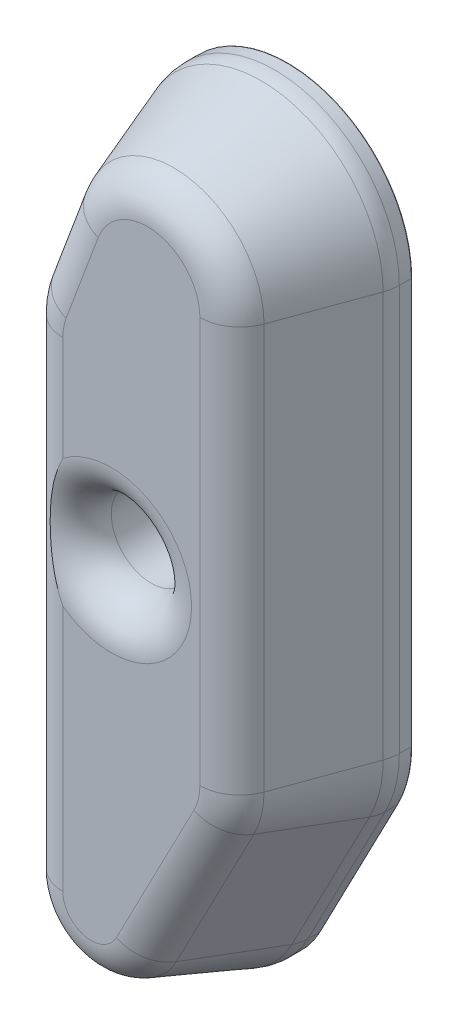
ISO-10303-21;
HEADER;
FILE_DESCRIPTION(('STEP AP214'),'2;1');
FILE_NAME('part.step','',(''),(''),'','','');
FILE_SCHEMA(('AUTOMOTIVE_DESIGN { 1 0 10303 214 1 1 1 1 }'));
ENDSEC;
DATA;
#1=APPLICATION_CONTEXT('core data for automotive mechanical design processes');
#2=APPLICATION_PROTOCOL_DEFINITION('international standard','automotive_design',2000,#1);
#3=PRODUCT_CONTEXT('',#1,'mechanical');
#4=PRODUCT('Part','Part','',(#3));
#5=PRODUCT_RELATED_PRODUCT_CATEGORY('part','',(#4));
#6=PRODUCT_DEFINITION_FORMATION('','',#4);
#7=PRODUCT_DEFINITION_CONTEXT('part definition',#1,'design');
#8=PRODUCT_DEFINITION('design','',#6,#7);
#9=PRODUCT_DEFINITION_SHAPE('','',#8);
#10=(LENGTH_UNIT() NAMED_UNIT(*) SI_UNIT(.MILLI.,.METRE.));
#11=(NAMED_UNIT(*) PLANE_ANGLE_UNIT() SI_UNIT($,.RADIAN.));
#12=(NAMED_UNIT(*) SI_UNIT($,.STERADIAN.) SOLID_ANGLE_UNIT());
#13=UNCERTAINTY_MEASURE_WITH_UNIT(LENGTH_MEASURE(1.E-05),#10,'distance_accuracy_value','');
#14=(GEOMETRIC_REPRESENTATION_CONTEXT(3) GLOBAL_UNCERTAINTY_ASSIGNED_CONTEXT((#13)) GLOBAL_UNIT_ASSIGNED_CONTEXT((#10,
#11,#12)) REPRESENTATION_CONTEXT('',''));
#15=CARTESIAN_POINT('',(0.,0.,0.));
#16=DIRECTION('',(0.,0.,1.));
#17=DIRECTION('',(1.,0.,0.));
#18=AXIS2_PLACEMENT_3D('',#15,#16,#17);
#19=CARTESIAN_POINT('',(32.799990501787,-8.900001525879,16.1));
#20=DIRECTION('',(0.,0.,-1.));
#21=DIRECTION('',(-1.,0.,0.));
#22=AXIS2_PLACEMENT_3D('',#19,#20,#21);
#23=CYLINDRICAL_SURFACE('',#22,6.20000016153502);
#24=DIRECTION('',(0.,0.,-1.));
#25=VECTOR('',#24,1.);
#26=CARTESIAN_POINT('',(38.999990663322,-8.900001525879,16.1));
#27=LINE('',#26,#25);
#28=CARTESIAN_POINT('',(38.999990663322,-8.900001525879,9.74734603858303));
#29=VERTEX_POINT('',#28);
#30=CARTESIAN_POINT('',(38.999990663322,-8.900001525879,9.15));
#31=VERTEX_POINT('',#30);
#32=EDGE_CURVE('E720',#29,#31,#27,.T.);
#33=ORIENTED_EDGE('',*,*,#32,.T.);
#34=CARTESIAN_POINT('',(32.799990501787,-8.900001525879,9.15));
#35=DIRECTION('',(0.,0.,1.));
#36=DIRECTION('',(1.,0.,0.));
#37=AXIS2_PLACEMENT_3D('',#34,#35,#36);
#38=CIRCLE('',#37,6.20000016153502);
#39=CARTESIAN_POINT('',(26.9928834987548,-6.72801850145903,9.15));
#40=VERTEX_POINT('',#39);
#41=EDGE_CURVE('E677',#31,#40,#38,.T.);
#42=ORIENTED_EDGE('',*,*,#41,.T.);
#43=DIRECTION('',(0.,0.,-1.));
#44=VECTOR('',#43,1.);
#45=CARTESIAN_POINT('',(26.9928834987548,-6.72801850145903,16.1));
#46=LINE('',#45,#44);
#47=CARTESIAN_POINT('',(26.9928834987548,-6.72801850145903,9.74734603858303));
#48=VERTEX_POINT('',#47);
#49=EDGE_CURVE('E252',#48,#40,#46,.T.);
#50=ORIENTED_EDGE('',*,*,#49,.F.);
#51=CARTESIAN_POINT('',(32.799990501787,-8.900001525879,9.74734603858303));
#52=DIRECTION('',(0.,0.,1.));
#53=DIRECTION('',(1.,0.,0.));
#54=AXIS2_PLACEMENT_3D('',#51,#52,#53);
#55=CIRCLE('',#54,6.20000016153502);
#56=EDGE_CURVE('E277',#48,#29,#55,.F.);
#57=ORIENTED_EDGE('',*,*,#56,.T.);
#58=EDGE_LOOP('',(#33,#42,#50,#57));
#59=FACE_BOUND('',#58,.T.);
#60=ADVANCED_FACE('F41',(#59),#23,.T.);
#61=CARTESIAN_POINT('',(26.9928834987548,-6.72801850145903,16.1));
#62=DIRECTION('',(0.936630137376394,-0.350319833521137,0.));
#63=DIRECTION('',(0.350319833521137,0.936630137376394,0.));
#64=AXIS2_PLACEMENT_3D('',#61,#62,#63);
#65=PLANE('',#64);
#66=ORIENTED_EDGE('',*,*,#49,.T.);
#67=DIRECTION('',(-0.350319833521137,-0.936630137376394,0.));
#68=VECTOR('',#67,1.);
#69=CARTESIAN_POINT('',(26.9928834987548,-6.72801850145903,9.15));
#70=LINE('',#69,#68);
#71=CARTESIAN_POINT('',(25.3928920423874,-11.0058243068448,9.15));
#72=VERTEX_POINT('',#71);
#73=EDGE_CURVE('E639',#40,#72,#70,.T.);
#74=ORIENTED_EDGE('',*,*,#73,.T.);
#75=DIRECTION('',(0.,0.,-1.));
#76=VECTOR('',#75,1.);
#77=CARTESIAN_POINT('',(25.3928920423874,-11.0058243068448,16.1));
#78=LINE('',#77,#76);
#79=CARTESIAN_POINT('',(25.3928920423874,-11.0058243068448,9.74734603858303));
#80=VERTEX_POINT('',#79);
#81=EDGE_CURVE('E256',#80,#72,#78,.T.);
#82=ORIENTED_EDGE('',*,*,#81,.F.);
#83=DIRECTION('',(0.350319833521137,0.936630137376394,0.));
#84=VECTOR('',#83,1.);
#85=CARTESIAN_POINT('',(26.9928834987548,-6.72801850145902,9.74734603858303));
#86=LINE('',#85,#84);
#87=EDGE_CURVE('E283',#80,#48,#86,.T.);
#88=ORIENTED_EDGE('',*,*,#87,.T.);
#89=EDGE_LOOP('',(#66,#74,#82,#88));
#90=FACE_BOUND('',#89,.T.);
#91=ADVANCED_FACE('F468',(#90),#65,.F.);
#92=CARTESIAN_POINT('',(31.199998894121,-13.1778072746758,16.1));
#93=DIRECTION('',(0.,0.,-1.));
#94=DIRECTION('',(-1.,0.,0.));
#95=AXIS2_PLACEMENT_3D('',#92,#93,#94);
#96=CYLINDRICAL_SURFACE('',#95,6.2);
#97=ORIENTED_EDGE('',*,*,#81,.T.);
#98=CARTESIAN_POINT('',(31.199998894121,-13.1778072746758,9.15));
#99=DIRECTION('',(0.,0.,1.));
#100=DIRECTION('',(1.,0.,0.));
#101=AXIS2_PLACEMENT_3D('',#98,#99,#100);
#102=CIRCLE('',#101,6.2);
#103=CARTESIAN_POINT('',(24.999998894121,-13.1778072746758,9.15));
#104=VERTEX_POINT('',#103);
#105=EDGE_CURVE('E668',#72,#104,#102,.T.);
#106=ORIENTED_EDGE('',*,*,#105,.T.);
#107=DIRECTION('',(0.,0.,-1.));
#108=VECTOR('',#107,1.);
#109=CARTESIAN_POINT('',(24.999998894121,-13.1778072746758,16.1));
#110=LINE('',#109,#108);
#111=CARTESIAN_POINT('',(24.999998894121,-13.1778072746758,9.74734603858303));
#112=VERTEX_POINT('',#111);
#113=EDGE_CURVE('E767',#112,#104,#110,.T.);
#114=ORIENTED_EDGE('',*,*,#113,.F.);
#115=CARTESIAN_POINT('',(31.199998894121,-13.1778072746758,9.74734603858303));
#116=DIRECTION('',(0.,0.,1.));
#117=DIRECTION('',(1.,0.,0.));
#118=AXIS2_PLACEMENT_3D('',#115,#116,#117);
#119=CIRCLE('',#118,6.2);
#120=EDGE_CURVE('E290',#112,#80,#119,.F.);
#121=ORIENTED_EDGE('',*,*,#120,.T.);
#122=EDGE_LOOP('',(#97,#106,#114,#121));
#123=FACE_BOUND('',#122,.T.);
#124=ADVANCED_FACE('F474',(#123),#96,.T.);
#125=CARTESIAN_POINT('',(24.999998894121,-13.1778072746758,16.1));
#126=DIRECTION('',(1.,0.,0.));
#127=DIRECTION('',(0.,1.,0.));
#128=AXIS2_PLACEMENT_3D('',#125,#126,#127);
#129=PLANE('',#128);
#130=ORIENTED_EDGE('',*,*,#113,.T.);
#131=DIRECTION('',(0.,-1.,0.));
#132=VECTOR('',#131,1.);
#133=CARTESIAN_POINT('',(24.999998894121,-13.1778072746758,9.15));
#134=LINE('',#133,#132);
#135=CARTESIAN_POINT('',(24.999998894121,-37.0832982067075,9.15));
#136=VERTEX_POINT('',#135);
#137=EDGE_CURVE('E670',#104,#136,#134,.T.);
#138=ORIENTED_EDGE('',*,*,#137,.T.);
#139=DIRECTION('',(0.,0.,-1.));
#140=VECTOR('',#139,1.);
#141=CARTESIAN_POINT('',(24.999998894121,-37.0832982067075,16.1));
#142=LINE('',#141,#140);
#143=CARTESIAN_POINT('',(24.999998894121,-37.0832982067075,9.74734603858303));
#144=VERTEX_POINT('',#143);
#145=EDGE_CURVE('E236',#144,#136,#142,.T.);
#146=ORIENTED_EDGE('',*,*,#145,.F.);
#147=DIRECTION('',(0.,1.,0.));
#148=VECTOR('',#147,1.);
#149=CARTESIAN_POINT('',(24.999998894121,-13.1778072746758,9.74734603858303));
#150=LINE('',#149,#148);
#151=EDGE_CURVE('E324',#144,#112,#150,.T.);
#152=ORIENTED_EDGE('',*,*,#151,.T.);
#153=EDGE_LOOP('',(#130,#138,#146,#152));
#154=FACE_BOUND('',#153,.T.);
#155=ADVANCED_FACE('F775',(#154),#129,.F.);
#156=CARTESIAN_POINT('',(29.999998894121,-37.0832982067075,16.1));
#157=DIRECTION('',(0.,0.,-1.));
#158=DIRECTION('',(-1.,0.,0.));
#159=AXIS2_PLACEMENT_3D('',#156,#157,#158);
#160=CYLINDRICAL_SURFACE('',#159,5.);
#161=ORIENTED_EDGE('',*,*,#145,.T.);
#162=CARTESIAN_POINT('',(29.999998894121,-37.0832982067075,9.15));
#163=DIRECTION('',(0.,0.,1.));
#164=DIRECTION('',(1.,0.,0.));
#165=AXIS2_PLACEMENT_3D('',#162,#163,#164);
#166=CIRCLE('',#165,5.);
#167=CARTESIAN_POINT('',(34.4357850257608,-39.3906346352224,9.15));
#168=VERTEX_POINT('',#167);
#169=EDGE_CURVE('E235',#136,#168,#166,.T.);
#170=ORIENTED_EDGE('',*,*,#169,.T.);
#171=DIRECTION('',(0.,0.,-1.));
#172=VECTOR('',#171,1.);
#173=CARTESIAN_POINT('',(34.4357850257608,-39.3906346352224,16.1));
#174=LINE('',#173,#172);
#175=CARTESIAN_POINT('',(34.4357850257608,-39.3906346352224,9.74734603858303));
#176=VERTEX_POINT('',#175);
#177=EDGE_CURVE('E217',#176,#168,#174,.T.);
#178=ORIENTED_EDGE('',*,*,#177,.F.);
#179=CARTESIAN_POINT('',(29.999998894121,-37.0832982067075,9.74734603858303));
#180=DIRECTION('',(0.,0.,1.));
#181=DIRECTION('',(1.,0.,0.));
#182=AXIS2_PLACEMENT_3D('',#179,#180,#181);
#183=CIRCLE('',#182,5.);
#184=EDGE_CURVE('E232',#176,#144,#183,.F.);
#185=ORIENTED_EDGE('',*,*,#184,.T.);
#186=EDGE_LOOP('',(#161,#170,#178,#185));
#187=FACE_BOUND('',#186,.T.);
#188=ADVANCED_FACE('F230',(#187),#160,.T.);
#189=CARTESIAN_POINT('',(38.3003667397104,-31.9610904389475,16.1));
#190=DIRECTION('',(-0.887157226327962,0.461467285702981,0.));
#191=DIRECTION('',(-0.461467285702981,-0.887157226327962,0.));
#192=AXIS2_PLACEMENT_3D('',#189,#190,#191);
#193=PLANE('',#192);
#194=ORIENTED_EDGE('',*,*,#177,.T.);
#195=DIRECTION('',(0.461467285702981,0.887157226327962,0.));
#196=VECTOR('',#195,1.);
#197=CARTESIAN_POINT('',(38.3003667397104,-31.9610904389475,9.15));
#198=LINE('',#197,#196);
#199=CARTESIAN_POINT('',(38.3003667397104,-31.9610904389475,9.15));
#200=VERTEX_POINT('',#199);
#201=EDGE_CURVE('E673',#168,#200,#198,.T.);
#202=ORIENTED_EDGE('',*,*,#201,.T.);
#203=DIRECTION('',(0.,0.,-1.));
#204=VECTOR('',#203,1.);
#205=CARTESIAN_POINT('',(38.3003667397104,-31.9610904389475,16.1));
#206=LINE('',#205,#204);
#207=CARTESIAN_POINT('',(38.3003667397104,-31.9610904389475,9.74734603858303));
#208=VERTEX_POINT('',#207);
#209=EDGE_CURVE('E219',#208,#200,#206,.T.);
#210=ORIENTED_EDGE('',*,*,#209,.F.);
#211=DIRECTION('',(-0.461467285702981,-0.887157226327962,0.));
#212=VECTOR('',#211,1.);
#213=CARTESIAN_POINT('',(34.4357850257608,-39.3906346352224,9.74734603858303));
#214=LINE('',#213,#212);
#215=EDGE_CURVE('E214',#208,#176,#214,.T.);
#216=ORIENTED_EDGE('',*,*,#215,.T.);
#217=EDGE_LOOP('',(#194,#202,#210,#216));
#218=FACE_BOUND('',#217,.T.);
#219=ADVANCED_FACE('F216',(#218),#193,.F.);
#220=CARTESIAN_POINT('',(32.800001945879,-29.09999847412,16.1));
#221=DIRECTION('',(0.,0.,-1.));
#222=DIRECTION('',(-1.,0.,0.));
#223=AXIS2_PLACEMENT_3D('',#220,#221,#222);
#224=CYLINDRICAL_SURFACE('',#223,6.19998871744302);
#225=ORIENTED_EDGE('',*,*,#209,.T.);
#226=CARTESIAN_POINT('',(32.800001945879,-29.09999847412,9.15));
#227=DIRECTION('',(0.,0.,1.));
#228=DIRECTION('',(1.,0.,0.));
#229=AXIS2_PLACEMENT_3D('',#226,#227,#228);
#230=CIRCLE('',#229,6.19998871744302);
#231=CARTESIAN_POINT('',(38.999990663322,-29.09999847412,9.15));
#232=VERTEX_POINT('',#231);
#233=EDGE_CURVE('E66',#200,#232,#230,.T.);
#234=ORIENTED_EDGE('',*,*,#233,.T.);
#235=DIRECTION('',(0.,0.,-1.));
#236=VECTOR('',#235,1.);
#237=CARTESIAN_POINT('',(38.999990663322,-29.09999847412,16.1));
#238=LINE('',#237,#236);
#239=CARTESIAN_POINT('',(38.999990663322,-29.09999847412,9.74734603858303));
#240=VERTEX_POINT('',#239);
#241=EDGE_CURVE('E759',#240,#232,#238,.T.);
#242=ORIENTED_EDGE('',*,*,#241,.F.);
#243=CARTESIAN_POINT('',(32.800001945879,-29.09999847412,9.74734603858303));
#244=DIRECTION('',(0.,0.,1.));
#245=DIRECTION('',(1.,0.,0.));
#246=AXIS2_PLACEMENT_3D('',#243,#244,#245);
#247=CIRCLE('',#246,6.19998871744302);
#248=EDGE_CURVE('E265',#240,#208,#247,.F.);
#249=ORIENTED_EDGE('',*,*,#248,.T.);
#250=EDGE_LOOP('',(#225,#234,#242,#249));
#251=FACE_BOUND('',#250,.T.);
#252=ADVANCED_FACE('F791',(#251),#224,.T.);
#253=CARTESIAN_POINT('',(38.999990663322,-8.900001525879,16.1));
#254=DIRECTION('',(-1.,0.,0.));
#255=DIRECTION('',(0.,-1.,0.));
#256=AXIS2_PLACEMENT_3D('',#253,#254,#255);
#257=PLANE('',#256);
#258=ORIENTED_EDGE('',*,*,#241,.T.);
#259=DIRECTION('',(0.,1.,0.));
#260=VECTOR('',#259,1.);
#261=CARTESIAN_POINT('',(38.999990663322,-8.900001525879,9.15));
#262=LINE('',#261,#260);
#263=EDGE_CURVE('E58',#232,#31,#262,.T.);
#264=ORIENTED_EDGE('',*,*,#263,.T.);
#265=ORIENTED_EDGE('',*,*,#32,.F.);
#266=DIRECTION('',(0.,-1.,0.));
#267=VECTOR('',#266,1.);
#268=CARTESIAN_POINT('',(38.999990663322,-29.09999847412,9.74734603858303));
#269=LINE('',#268,#267);
#270=EDGE_CURVE('E271',#29,#240,#269,.T.);
#271=ORIENTED_EDGE('',*,*,#270,.T.);
#272=EDGE_LOOP('',(#258,#264,#265,#271));
#273=FACE_BOUND('',#272,.T.);
#274=ADVANCED_FACE('F758',(#273),#257,.F.);
#275=CARTESIAN_POINT('',(32.799990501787,-8.900001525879,16.1));
#276=DIRECTION('',(0.,0.,1.));
#277=DIRECTION('',(1.,0.,0.));
#278=AXIS2_PLACEMENT_3D('',#275,#276,#277);
#279=PLANE('',#278);
#280=DIRECTION('',(-0.350319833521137,-0.936630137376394,0.));
#281=VECTOR('',#280,1.);
#282=CARTESIAN_POINT('',(30.3499874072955,-7.98364762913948,16.1));
#283=LINE('',#282,#281);
#284=CARTESIAN_POINT('',(30.3499874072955,-7.98364762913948,16.1));
#285=VERTEX_POINT('',#284);
#286=CARTESIAN_POINT('',(28.7499959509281,-12.2614534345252,16.1));
#287=VERTEX_POINT('',#286);
#288=EDGE_CURVE('E312',#285,#287,#283,.T.);
#289=ORIENTED_EDGE('',*,*,#288,.T.);
#290=CARTESIAN_POINT('',(31.199998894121,-13.1778072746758,16.1));
#291=DIRECTION('',(0.,0.,1.));
#292=DIRECTION('',(1.,0.,0.));
#293=AXIS2_PLACEMENT_3D('',#290,#291,#292);
#294=CIRCLE('',#293,2.61576351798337);
#295=CARTESIAN_POINT('',(28.5842353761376,-13.1778072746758,16.1));
#296=VERTEX_POINT('',#295);
#297=EDGE_CURVE('E315',#287,#296,#294,.T.);
#298=ORIENTED_EDGE('',*,*,#297,.T.);
#299=DIRECTION('',(0.,-1.,0.));
#300=VECTOR('',#299,1.);
#301=CARTESIAN_POINT('',(28.5842353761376,-8.900001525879,16.1));
#302=LINE('',#301,#300);
#303=CARTESIAN_POINT('',(28.5842353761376,-18.3918317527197,16.1));
#304=VERTEX_POINT('',#303);
#305=EDGE_CURVE('E300',#296,#304,#302,.T.);
#306=ORIENTED_EDGE('',*,*,#305,.T.);
#307=CARTESIAN_POINT('',(30.999998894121,-21.5799482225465,16.1));
#308=DIRECTION('',(0.,0.,1.));
#309=DIRECTION('',(1.,0.,0.));
#310=AXIS2_PLACEMENT_3D('',#307,#308,#309);
#311=CIRCLE('',#310,4.);
#312=CARTESIAN_POINT('',(28.5842353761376,-24.7680646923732,16.1));
#313=VERTEX_POINT('',#312);
#314=EDGE_CURVE('E296',#304,#313,#311,.F.);
#315=ORIENTED_EDGE('',*,*,#314,.T.);
#316=DIRECTION('',(0.,-1.,0.));
#317=VECTOR('',#316,1.);
#318=CARTESIAN_POINT('',(28.5842353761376,-8.900001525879,16.1));
#319=LINE('',#318,#317);
#320=CARTESIAN_POINT('',(28.5842353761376,-37.0832982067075,16.1));
#321=VERTEX_POINT('',#320);
#322=EDGE_CURVE('E298',#313,#321,#319,.T.);
#323=ORIENTED_EDGE('',*,*,#322,.T.);
#324=CARTESIAN_POINT('',(29.999998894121,-37.0832982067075,16.1));
#325=DIRECTION('',(0.,0.,1.));
#326=DIRECTION('',(1.,0.,0.));
#327=AXIS2_PLACEMENT_3D('',#324,#325,#326);
#328=CIRCLE('',#327,1.41576351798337);
#329=CARTESIAN_POINT('',(31.2560037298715,-37.7366267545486,16.1));
#330=VERTEX_POINT('',#329);
#331=EDGE_CURVE('E302',#321,#330,#328,.T.);
#332=ORIENTED_EDGE('',*,*,#331,.T.);
#333=DIRECTION('',(0.461467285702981,0.887157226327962,0.));
#334=VECTOR('',#333,1.);
#335=CARTESIAN_POINT('',(43.3903413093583,-14.4087211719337,16.1));
#336=LINE('',#335,#334);
#337=CARTESIAN_POINT('',(35.1205854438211,-30.3070825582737,16.1));
#338=VERTEX_POINT('',#337);
#339=EDGE_CURVE('E304',#330,#338,#336,.T.);
#340=ORIENTED_EDGE('',*,*,#339,.T.);
#341=CARTESIAN_POINT('',(32.800001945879,-29.09999847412,16.1));
#342=DIRECTION('',(0.,0.,1.));
#343=DIRECTION('',(1.,0.,0.));
#344=AXIS2_PLACEMENT_3D('',#341,#342,#343);
#345=CIRCLE('',#344,2.61575223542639);
#346=CARTESIAN_POINT('',(35.4157541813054,-29.09999847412,16.1));
#347=VERTEX_POINT('',#346);
#348=EDGE_CURVE('E306',#338,#347,#345,.T.);
#349=ORIENTED_EDGE('',*,*,#348,.T.);
#350=DIRECTION('',(0.,1.,0.));
#351=VECTOR('',#350,1.);
#352=CARTESIAN_POINT('',(35.4157541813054,-8.900001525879,16.1));
#353=LINE('',#352,#351);
#354=CARTESIAN_POINT('',(35.4157541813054,-8.900001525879,16.1));
#355=VERTEX_POINT('',#354);
#356=EDGE_CURVE('E308',#347,#355,#353,.T.);
#357=ORIENTED_EDGE('',*,*,#356,.T.);
#358=CARTESIAN_POINT('',(32.799990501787,-8.900001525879,16.1));
#359=DIRECTION('',(0.,0.,1.));
#360=DIRECTION('',(1.,0.,0.));
#361=AXIS2_PLACEMENT_3D('',#358,#359,#360);
#362=CIRCLE('',#361,2.61576367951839);
#363=EDGE_CURVE('E310',#355,#285,#362,.T.);
#364=ORIENTED_EDGE('',*,*,#363,.T.);
#365=EDGE_LOOP('',(#289,#298,#306,#315,#323,#332,#340,#349,#357,#364));
#366=FACE_BOUND('',#365,.T.);
#367=ADVANCED_FACE('F796',(#366),#279,.T.);
#368=CARTESIAN_POINT('',(32.799990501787,-8.900001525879,9.1));
#369=DIRECTION('',(0.,0.,1.));
#370=DIRECTION('',(1.,0.,0.));
#371=AXIS2_PLACEMENT_3D('',#368,#369,#370);
#372=PLANE('',#371);
#373=CARTESIAN_POINT('',(31.199998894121,-13.1778072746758,9.1));
#374=DIRECTION('',(0.,0.,1.));
#375=DIRECTION('',(1.,0.,0.));
#376=AXIS2_PLACEMENT_3D('',#373,#374,#375);
#377=CIRCLE('',#376,6.15);
#378=CARTESIAN_POINT('',(25.049998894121,-13.1778072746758,9.1));
#379=VERTEX_POINT('',#378);
#380=CARTESIAN_POINT('',(25.4397235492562,-11.0233402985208,9.1));
#381=VERTEX_POINT('',#380);
#382=EDGE_CURVE('E663',#379,#381,#377,.F.);
#383=ORIENTED_EDGE('',*,*,#382,.T.);
#384=DIRECTION('',(-0.350319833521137,-0.936630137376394,0.));
#385=VECTOR('',#384,1.);
#386=CARTESIAN_POINT('',(27.0397150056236,-6.74553449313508,9.1));
#387=LINE('',#386,#385);
#388=CARTESIAN_POINT('',(27.0397150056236,-6.74553449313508,9.1));
#389=VERTEX_POINT('',#388);
#390=EDGE_CURVE('E665',#381,#389,#387,.F.);
#391=ORIENTED_EDGE('',*,*,#390,.T.);
#392=CARTESIAN_POINT('',(32.799990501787,-8.900001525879,9.1));
#393=DIRECTION('',(0.,0.,1.));
#394=DIRECTION('',(1.,0.,0.));
#395=AXIS2_PLACEMENT_3D('',#392,#393,#394);
#396=CIRCLE('',#395,6.15000016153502);
#397=CARTESIAN_POINT('',(38.949990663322,-8.900001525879,9.1));
#398=VERTEX_POINT('',#397);
#399=EDGE_CURVE('E651',#389,#398,#396,.F.);
#400=ORIENTED_EDGE('',*,*,#399,.T.);
#401=DIRECTION('',(0.,1.,0.));
#402=VECTOR('',#401,1.);
#403=CARTESIAN_POINT('',(38.949990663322,-8.900001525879,9.1));
#404=LINE('',#403,#402);
#405=CARTESIAN_POINT('',(38.949990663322,-29.09999847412,9.1));
#406=VERTEX_POINT('',#405);
#407=EDGE_CURVE('E653',#398,#406,#404,.F.);
#408=ORIENTED_EDGE('',*,*,#407,.T.);
#409=CARTESIAN_POINT('',(32.800001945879,-29.09999847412,9.1));
#410=DIRECTION('',(0.,0.,1.));
#411=DIRECTION('',(1.,0.,0.));
#412=AXIS2_PLACEMENT_3D('',#409,#410,#411);
#413=CIRCLE('',#412,6.14998871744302);
#414=CARTESIAN_POINT('',(38.256008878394,-31.9380170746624,9.1));
#415=VERTEX_POINT('',#414);
#416=EDGE_CURVE('E655',#406,#415,#413,.F.);
#417=ORIENTED_EDGE('',*,*,#416,.T.);
#418=DIRECTION('',(0.461467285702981,0.887157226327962,0.));
#419=VECTOR('',#418,1.);
#420=CARTESIAN_POINT('',(46.5257647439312,-16.0396556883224,9.1));
#421=LINE('',#420,#419);
#422=CARTESIAN_POINT('',(34.3914271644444,-39.3675612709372,9.1));
#423=VERTEX_POINT('',#422);
#424=EDGE_CURVE('E657',#415,#423,#421,.F.);
#425=ORIENTED_EDGE('',*,*,#424,.T.);
#426=CARTESIAN_POINT('',(29.999998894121,-37.0832982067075,9.1));
#427=DIRECTION('',(0.,0.,1.));
#428=DIRECTION('',(1.,0.,0.));
#429=AXIS2_PLACEMENT_3D('',#426,#427,#428);
#430=CIRCLE('',#429,4.95);
#431=CARTESIAN_POINT('',(25.049998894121,-37.0832982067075,9.1));
#432=VERTEX_POINT('',#431);
#433=EDGE_CURVE('E659',#423,#432,#430,.F.);
#434=ORIENTED_EDGE('',*,*,#433,.T.);
#435=DIRECTION('',(0.,-1.,0.));
#436=VECTOR('',#435,1.);
#437=CARTESIAN_POINT('',(25.049998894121,-8.900001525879,9.1));
#438=LINE('',#437,#436);
#439=EDGE_CURVE('E661',#432,#379,#438,.F.);
#440=ORIENTED_EDGE('',*,*,#439,.T.);
#441=EDGE_LOOP('',(#383,#391,#400,#408,#417,#425,#434,#440));
#442=FACE_BOUND('',#441,.T.);
#443=CARTESIAN_POINT('',(28.499998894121,-17.59999847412,9.1));
#444=DIRECTION('',(0.,0.,1.));
#445=DIRECTION('',(1.,0.,0.));
#446=AXIS2_PLACEMENT_3D('',#443,#444,#445);
#447=CIRCLE('',#446,2.25);
#448=CARTESIAN_POINT('',(30.749998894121,-17.59999847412,9.1));
#449=VERTEX_POINT('',#448);
#450=EDGE_CURVE('E648',#449,#449,#447,.T.);
#451=ORIENTED_EDGE('',*,*,#450,.T.);
#452=EDGE_LOOP('',(#451));
#453=FACE_BOUND('',#452,.T.);
#454=CARTESIAN_POINT('',(28.499998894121,-37.80000305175,9.1));
#455=DIRECTION('',(0.,0.,1.));
#456=DIRECTION('',(1.,0.,0.));
#457=AXIS2_PLACEMENT_3D('',#454,#455,#456);
#458=CIRCLE('',#457,2.25);
#459=CARTESIAN_POINT('',(30.749998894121,-37.80000305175,9.1));
#460=VERTEX_POINT('',#459);
#461=EDGE_CURVE('E645',#460,#460,#458,.T.);
#462=ORIENTED_EDGE('',*,*,#461,.T.);
#463=EDGE_LOOP('',(#462));
#464=FACE_BOUND('',#463,.T.);
#465=CARTESIAN_POINT('',(30.999998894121,-21.5799482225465,9.1));
#466=DIRECTION('',(0.,0.,1.));
#467=DIRECTION('',(1.,0.,0.));
#468=AXIS2_PLACEMENT_3D('',#465,#466,#467);
#469=CIRCLE('',#468,0.85);
#470=CARTESIAN_POINT('',(31.849998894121,-21.5799482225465,9.1));
#471=VERTEX_POINT('',#470);
#472=EDGE_CURVE('E642',#471,#471,#469,.T.);
#473=ORIENTED_EDGE('',*,*,#472,.T.);
#474=EDGE_LOOP('',(#473));
#475=FACE_BOUND('',#474,.T.);
#476=CARTESIAN_POINT('',(32.800001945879,-29.09999847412,9.1));
#477=DIRECTION('',(0.,0.,1.));
#478=DIRECTION('',(1.,0.,0.));
#479=AXIS2_PLACEMENT_3D('',#476,#477,#478);
#480=CIRCLE('',#479,3.80000016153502);
#481=CARTESIAN_POINT('',(36.600002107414,-29.09999847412,9.1));
#482=VERTEX_POINT('',#481);
#483=EDGE_CURVE('E636',#482,#482,#480,.T.);
#484=ORIENTED_EDGE('',*,*,#483,.T.);
#485=EDGE_LOOP('',(#484));
#486=FACE_BOUND('',#485,.T.);
#487=CARTESIAN_POINT('',(32.799990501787,-8.900001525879,9.1));
#488=DIRECTION('',(0.,0.,1.));
#489=DIRECTION('',(1.,0.,0.));
#490=AXIS2_PLACEMENT_3D('',#487,#488,#489);
#491=CIRCLE('',#490,3.80000016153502);
#492=CARTESIAN_POINT('',(36.599990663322,-8.900001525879,9.1));
#493=VERTEX_POINT('',#492);
#494=EDGE_CURVE('E633',#493,#493,#491,.T.);
#495=ORIENTED_EDGE('',*,*,#494,.T.);
#496=EDGE_LOOP('',(#495));
#497=FACE_BOUND('',#496,.T.);
#498=ADVANCED_FACE('F709',(#442,#453,#464,#475,#486,#497),#372,.F.);
#499=CARTESIAN_POINT('',(32.799990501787,-8.900001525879,15.6));
#500=DIRECTION('',(0.,0.,-1.));
#501=DIRECTION('',(-1.,0.,0.));
#502=AXIS2_PLACEMENT_3D('',#499,#500,#501);
#503=CYLINDRICAL_SURFACE('',#502,3.50000016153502);
#504=CARTESIAN_POINT('',(32.799990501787,-8.900001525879,15.3));
#505=DIRECTION('',(0.,0.,-1.));
#506=DIRECTION('',(-1.,0.,0.));
#507=AXIS2_PLACEMENT_3D('',#504,#505,#506);
#508=CIRCLE('',#507,3.50000016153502);
#509=CARTESIAN_POINT('',(29.299990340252,-8.900001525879,15.3));
#510=VERTEX_POINT('',#509);
#511=EDGE_CURVE('E630',#510,#510,#508,.F.);
#512=CARTESIAN_POINT('',(32.799990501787,-8.900001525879,9.4));
#513=DIRECTION('',(0.,0.,1.));
#514=DIRECTION('',(1.,0.,0.));
#515=AXIS2_PLACEMENT_3D('',#512,#513,#514);
#516=CIRCLE('',#515,3.50000016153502);
#517=CARTESIAN_POINT('',(29.299990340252,-8.900001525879,9.4));
#518=VERTEX_POINT('',#517);
#519=EDGE_CURVE('E627',#518,#518,#516,.F.);
#520=CARTESIAN_POINT('',(29.299990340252,-8.900001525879,15.3));
#521=CARTESIAN_POINT('',(29.299990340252,-8.900001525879,15.2385416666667));
#522=CARTESIAN_POINT('',(29.299990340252,-8.900001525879,15.1770833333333));
#523=CARTESIAN_POINT('',(29.299990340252,-8.900001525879,15.0541666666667));
#524=CARTESIAN_POINT('',(29.299990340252,-8.900001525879,14.9927083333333));
#525=CARTESIAN_POINT('',(29.299990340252,-8.900001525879,14.8697916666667));
#526=CARTESIAN_POINT('',(29.299990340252,-8.900001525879,14.8083333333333));
#527=CARTESIAN_POINT('',(29.299990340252,-8.900001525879,14.6854166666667));
#528=CARTESIAN_POINT('',(29.299990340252,-8.900001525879,14.6239583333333));
#529=CARTESIAN_POINT('',(29.299990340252,-8.900001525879,14.5010416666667));
#530=CARTESIAN_POINT('',(29.299990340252,-8.900001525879,14.4395833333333));
#531=CARTESIAN_POINT('',(29.299990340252,-8.900001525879,14.3166666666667));
#532=CARTESIAN_POINT('',(29.299990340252,-8.900001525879,14.2552083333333));
#533=CARTESIAN_POINT('',(29.299990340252,-8.900001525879,14.1322916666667));
#534=CARTESIAN_POINT('',(29.299990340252,-8.900001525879,14.0708333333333));
#535=CARTESIAN_POINT('',(29.299990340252,-8.900001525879,13.9479166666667));
#536=CARTESIAN_POINT('',(29.299990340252,-8.900001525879,13.8864583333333));
#537=CARTESIAN_POINT('',(29.299990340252,-8.900001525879,13.7635416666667));
#538=CARTESIAN_POINT('',(29.299990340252,-8.900001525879,13.7020833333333));
#539=CARTESIAN_POINT('',(29.299990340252,-8.900001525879,13.5791666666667));
#540=CARTESIAN_POINT('',(29.299990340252,-8.900001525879,13.5177083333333));
#541=CARTESIAN_POINT('',(29.299990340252,-8.900001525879,13.3947916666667));
#542=CARTESIAN_POINT('',(29.299990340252,-8.900001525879,13.3333333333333));
#543=CARTESIAN_POINT('',(29.299990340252,-8.900001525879,13.2104166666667));
#544=CARTESIAN_POINT('',(29.299990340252,-8.900001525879,13.1489583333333));
#545=CARTESIAN_POINT('',(29.299990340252,-8.900001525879,13.0260416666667));
#546=CARTESIAN_POINT('',(29.299990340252,-8.900001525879,12.9645833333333));
#547=CARTESIAN_POINT('',(29.299990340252,-8.900001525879,12.8416666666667));
#548=CARTESIAN_POINT('',(29.299990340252,-8.900001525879,12.7802083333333));
#549=CARTESIAN_POINT('',(29.299990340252,-8.900001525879,12.6572916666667));
#550=CARTESIAN_POINT('',(29.299990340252,-8.900001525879,12.5958333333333));
#551=CARTESIAN_POINT('',(29.299990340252,-8.900001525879,12.4729166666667));
#552=CARTESIAN_POINT('',(29.299990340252,-8.900001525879,12.4114583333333));
#553=CARTESIAN_POINT('',(29.299990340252,-8.900001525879,12.2885416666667));
#554=CARTESIAN_POINT('',(29.299990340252,-8.900001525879,12.2270833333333));
#555=CARTESIAN_POINT('',(29.299990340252,-8.900001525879,12.1041666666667));
#556=CARTESIAN_POINT('',(29.299990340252,-8.900001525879,12.0427083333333));
#557=CARTESIAN_POINT('',(29.299990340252,-8.900001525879,11.9197916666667));
#558=CARTESIAN_POINT('',(29.299990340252,-8.900001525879,11.8583333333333));
#559=CARTESIAN_POINT('',(29.299990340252,-8.900001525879,11.7354166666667));
#560=CARTESIAN_POINT('',(29.299990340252,-8.900001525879,11.6739583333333));
#561=CARTESIAN_POINT('',(29.299990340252,-8.900001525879,11.5510416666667));
#562=CARTESIAN_POINT('',(29.299990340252,-8.900001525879,11.4895833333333));
#563=CARTESIAN_POINT('',(29.299990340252,-8.900001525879,11.3666666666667));
#564=CARTESIAN_POINT('',(29.299990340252,-8.900001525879,11.3052083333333));
#565=CARTESIAN_POINT('',(29.299990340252,-8.900001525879,11.1822916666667));
#566=CARTESIAN_POINT('',(29.299990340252,-8.900001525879,11.1208333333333));
#567=CARTESIAN_POINT('',(29.299990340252,-8.900001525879,10.9979166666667));
#568=CARTESIAN_POINT('',(29.299990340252,-8.900001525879,10.9364583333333));
#569=CARTESIAN_POINT('',(29.299990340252,-8.900001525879,10.8135416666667));
#570=CARTESIAN_POINT('',(29.299990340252,-8.900001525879,10.7520833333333));
#571=CARTESIAN_POINT('',(29.299990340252,-8.900001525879,10.6291666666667));
#572=CARTESIAN_POINT('',(29.299990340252,-8.900001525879,10.5677083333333));
#573=CARTESIAN_POINT('',(29.299990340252,-8.900001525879,10.4447916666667));
#574=CARTESIAN_POINT('',(29.299990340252,-8.900001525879,10.3833333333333));
#575=CARTESIAN_POINT('',(29.299990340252,-8.900001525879,10.2604166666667));
#576=CARTESIAN_POINT('',(29.299990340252,-8.900001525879,10.1989583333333));
#577=CARTESIAN_POINT('',(29.299990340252,-8.900001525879,10.0760416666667));
#578=CARTESIAN_POINT('',(29.299990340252,-8.900001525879,10.0145833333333));
#579=CARTESIAN_POINT('',(29.299990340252,-8.900001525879,9.89166666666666));
#580=CARTESIAN_POINT('',(29.299990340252,-8.900001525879,9.83020833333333));
#581=CARTESIAN_POINT('',(29.299990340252,-8.900001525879,9.70729166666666));
#582=CARTESIAN_POINT('',(29.299990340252,-8.900001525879,9.64583333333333));
#583=CARTESIAN_POINT('',(29.299990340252,-8.900001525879,9.52291666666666));
#584=CARTESIAN_POINT('',(29.299990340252,-8.900001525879,9.46145833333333));
#585=CARTESIAN_POINT('',(29.299990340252,-8.900001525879,9.4));
#586=B_SPLINE_CURVE_WITH_KNOTS('',3,(#520,#521,#522,#523,#524,#525,#526,#527,#528,#529,#530,
#531,#532,#533,#534,#535,#536,#537,#538,#539,#540,#541,#542,#543,#544,#545,#546,#547,#548,#549,
#550,#551,#552,#553,#554,#555,#556,#557,#558,#559,#560,#561,#562,#563,#564,#565,#566,#567,#568,
#569,#570,#571,#572,#573,#574,#575,#576,#577,#578,#579,#580,#581,#582,#583,#584,#585),
.UNSPECIFIED.,.F.,.F.,(4,2,2,2,2,2,2,2,2,2,2,2,2,2,2,2,2,2,2,2,2,2,2,2,2,2,2,2,2,2,2,2,4),(0.,
0.184374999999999,0.368749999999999,0.553125,0.737499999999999,0.921874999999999,1.10625,
1.290625,1.475,1.659375,1.84375,2.028125,2.2125,2.396875,2.58125,2.765625,2.95,3.134375,3.31875,
3.503125,3.6875,3.871875,4.05625,4.240625,4.425,4.609375,4.79375,4.978125,5.1625,5.346875,
5.53125,5.715625,5.9),.UNSPECIFIED.);
#587=EDGE_CURVE('BSEAM799',#510,#518,#586,.T.);
#588=ORIENTED_EDGE('',*,*,#511,.T.);
#589=ORIENTED_EDGE('',*,*,#519,.T.);
#590=ORIENTED_EDGE('',*,*,#587,.T.);
#591=ORIENTED_EDGE('',*,*,#587,.F.);
#592=EDGE_LOOP('',(#588,#590,#589,#591));
#593=FACE_BOUND('',#592,.T.);
#594=ADVANCED_FACE('F799',(#593),#503,.F.);
#595=CARTESIAN_POINT('',(32.799990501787,-8.900001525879,15.6));
#596=DIRECTION('',(0.,0.,-1.));
#597=DIRECTION('',(-1.,0.,0.));
#598=AXIS2_PLACEMENT_3D('',#595,#596,#597);
#599=PLANE('',#598);
#600=CARTESIAN_POINT('',(32.799990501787,-8.900001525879,15.6));
#601=DIRECTION('',(0.,0.,-1.));
#602=DIRECTION('',(-1.,0.,0.));
#603=AXIS2_PLACEMENT_3D('',#600,#601,#602);
#604=CIRCLE('',#603,3.20000016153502);
#605=CARTESIAN_POINT('',(29.599990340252,-8.900001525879,15.6));
#606=VERTEX_POINT('',#605);
#607=EDGE_CURVE('E624',#606,#606,#604,.T.);
#608=ORIENTED_EDGE('',*,*,#607,.T.);
#609=EDGE_LOOP('',(#608));
#610=FACE_BOUND('',#609,.T.);
#611=ADVANCED_FACE('F803',(#610),#599,.T.);
#612=CARTESIAN_POINT('',(32.800001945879,-29.09999847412,15.6));
#613=DIRECTION('',(0.,0.,-1.));
#614=DIRECTION('',(-1.,0.,0.));
#615=AXIS2_PLACEMENT_3D('',#612,#613,#614);
#616=CYLINDRICAL_SURFACE('',#615,3.50000016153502);
#617=CARTESIAN_POINT('',(32.800001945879,-29.09999847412,15.3));
#618=DIRECTION('',(0.,0.,-1.));
#619=DIRECTION('',(-1.,0.,0.));
#620=AXIS2_PLACEMENT_3D('',#617,#618,#619);
#621=CIRCLE('',#620,3.50000016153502);
#622=CARTESIAN_POINT('',(29.300001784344,-29.09999847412,15.3));
#623=VERTEX_POINT('',#622);
#624=EDGE_CURVE('E621',#623,#623,#621,.F.);
#625=CARTESIAN_POINT('',(32.800001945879,-29.09999847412,9.4));
#626=DIRECTION('',(0.,0.,1.));
#627=DIRECTION('',(1.,0.,0.));
#628=AXIS2_PLACEMENT_3D('',#625,#626,#627);
#629=CIRCLE('',#628,3.50000016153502);
#630=CARTESIAN_POINT('',(29.300001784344,-29.09999847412,9.4));
#631=VERTEX_POINT('',#630);
#632=EDGE_CURVE('E618',#631,#631,#629,.F.);
#633=CARTESIAN_POINT('',(29.300001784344,-29.09999847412,15.3));
#634=CARTESIAN_POINT('',(29.300001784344,-29.09999847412,15.2385416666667));
#635=CARTESIAN_POINT('',(29.300001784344,-29.09999847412,15.1770833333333));
#636=CARTESIAN_POINT('',(29.300001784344,-29.09999847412,15.0541666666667));
#637=CARTESIAN_POINT('',(29.300001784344,-29.09999847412,14.9927083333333));
#638=CARTESIAN_POINT('',(29.300001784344,-29.09999847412,14.8697916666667));
#639=CARTESIAN_POINT('',(29.300001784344,-29.09999847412,14.8083333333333));
#640=CARTESIAN_POINT('',(29.300001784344,-29.09999847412,14.6854166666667));
#641=CARTESIAN_POINT('',(29.300001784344,-29.09999847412,14.6239583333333));
#642=CARTESIAN_POINT('',(29.300001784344,-29.09999847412,14.5010416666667));
#643=CARTESIAN_POINT('',(29.300001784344,-29.09999847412,14.4395833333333));
#644=CARTESIAN_POINT('',(29.300001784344,-29.09999847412,14.3166666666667));
#645=CARTESIAN_POINT('',(29.300001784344,-29.09999847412,14.2552083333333));
#646=CARTESIAN_POINT('',(29.300001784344,-29.09999847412,14.1322916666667));
#647=CARTESIAN_POINT('',(29.300001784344,-29.09999847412,14.0708333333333));
#648=CARTESIAN_POINT('',(29.300001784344,-29.09999847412,13.9479166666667));
#649=CARTESIAN_POINT('',(29.300001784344,-29.09999847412,13.8864583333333));
#650=CARTESIAN_POINT('',(29.300001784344,-29.09999847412,13.7635416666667));
#651=CARTESIAN_POINT('',(29.300001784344,-29.09999847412,13.7020833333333));
#652=CARTESIAN_POINT('',(29.300001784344,-29.09999847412,13.5791666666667));
#653=CARTESIAN_POINT('',(29.300001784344,-29.09999847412,13.5177083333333));
#654=CARTESIAN_POINT('',(29.300001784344,-29.09999847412,13.3947916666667));
#655=CARTESIAN_POINT('',(29.300001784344,-29.09999847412,13.3333333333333));
#656=CARTESIAN_POINT('',(29.300001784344,-29.09999847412,13.2104166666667));
#657=CARTESIAN_POINT('',(29.300001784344,-29.09999847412,13.1489583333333));
#658=CARTESIAN_POINT('',(29.300001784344,-29.09999847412,13.0260416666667));
#659=CARTESIAN_POINT('',(29.300001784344,-29.09999847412,12.9645833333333));
#660=CARTESIAN_POINT('',(29.300001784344,-29.09999847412,12.8416666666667));
#661=CARTESIAN_POINT('',(29.300001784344,-29.09999847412,12.7802083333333));
#662=CARTESIAN_POINT('',(29.300001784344,-29.09999847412,12.6572916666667));
#663=CARTESIAN_POINT('',(29.300001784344,-29.09999847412,12.5958333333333));
#664=CARTESIAN_POINT('',(29.300001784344,-29.09999847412,12.4729166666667));
#665=CARTESIAN_POINT('',(29.300001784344,-29.09999847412,12.4114583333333));
#666=CARTESIAN_POINT('',(29.300001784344,-29.09999847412,12.2885416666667));
#667=CARTESIAN_POINT('',(29.300001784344,-29.09999847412,12.2270833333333));
#668=CARTESIAN_POINT('',(29.300001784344,-29.09999847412,12.1041666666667));
#669=CARTESIAN_POINT('',(29.300001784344,-29.09999847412,12.0427083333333));
#670=CARTESIAN_POINT('',(29.300001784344,-29.09999847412,11.9197916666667));
#671=CARTESIAN_POINT('',(29.300001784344,-29.09999847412,11.8583333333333));
#672=CARTESIAN_POINT('',(29.300001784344,-29.09999847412,11.7354166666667));
#673=CARTESIAN_POINT('',(29.300001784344,-29.09999847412,11.6739583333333));
#674=CARTESIAN_POINT('',(29.300001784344,-29.09999847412,11.5510416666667));
#675=CARTESIAN_POINT('',(29.300001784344,-29.09999847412,11.4895833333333));
#676=CARTESIAN_POINT('',(29.300001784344,-29.09999847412,11.3666666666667));
#677=CARTESIAN_POINT('',(29.300001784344,-29.09999847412,11.3052083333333));
#678=CARTESIAN_POINT('',(29.300001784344,-29.09999847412,11.1822916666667));
#679=CARTESIAN_POINT('',(29.300001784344,-29.09999847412,11.1208333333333));
#680=CARTESIAN_POINT('',(29.300001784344,-29.09999847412,10.9979166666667));
#681=CARTESIAN_POINT('',(29.300001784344,-29.09999847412,10.9364583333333));
#682=CARTESIAN_POINT('',(29.300001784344,-29.09999847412,10.8135416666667));
#683=CARTESIAN_POINT('',(29.300001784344,-29.09999847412,10.7520833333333));
#684=CARTESIAN_POINT('',(29.300001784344,-29.09999847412,10.6291666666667));
#685=CARTESIAN_POINT('',(29.300001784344,-29.09999847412,10.5677083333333));
#686=CARTESIAN_POINT('',(29.300001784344,-29.09999847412,10.4447916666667));
#687=CARTESIAN_POINT('',(29.300001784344,-29.09999847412,10.3833333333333));
#688=CARTESIAN_POINT('',(29.300001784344,-29.09999847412,10.2604166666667));
#689=CARTESIAN_POINT('',(29.300001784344,-29.09999847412,10.1989583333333));
#690=CARTESIAN_POINT('',(29.300001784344,-29.09999847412,10.0760416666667));
#691=CARTESIAN_POINT('',(29.300001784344,-29.09999847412,10.0145833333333));
#692=CARTESIAN_POINT('',(29.300001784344,-29.09999847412,9.89166666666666));
#693=CARTESIAN_POINT('',(29.300001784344,-29.09999847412,9.83020833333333));
#694=CARTESIAN_POINT('',(29.300001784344,-29.09999847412,9.70729166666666));
#695=CARTESIAN_POINT('',(29.300001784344,-29.09999847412,9.64583333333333));
#696=CARTESIAN_POINT('',(29.300001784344,-29.09999847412,9.52291666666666));
#697=CARTESIAN_POINT('',(29.300001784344,-29.09999847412,9.46145833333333));
#698=CARTESIAN_POINT('',(29.300001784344,-29.09999847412,9.4));
#699=B_SPLINE_CURVE_WITH_KNOTS('',3,(#633,#634,#635,#636,#637,#638,#639,#640,#641,#642,#643,
#644,#645,#646,#647,#648,#649,#650,#651,#652,#653,#654,#655,#656,#657,#658,#659,#660,#661,#662,
#663,#664,#665,#666,#667,#668,#669,#670,#671,#672,#673,#674,#675,#676,#677,#678,#679,#680,#681,
#682,#683,#684,#685,#686,#687,#688,#689,#690,#691,#692,#693,#694,#695,#696,#697,#698),
.UNSPECIFIED.,.F.,.F.,(4,2,2,2,2,2,2,2,2,2,2,2,2,2,2,2,2,2,2,2,2,2,2,2,2,2,2,2,2,2,2,2,4),(0.,
0.184374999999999,0.368749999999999,0.553125,0.737499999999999,0.921874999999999,1.10625,
1.290625,1.475,1.659375,1.84375,2.028125,2.2125,2.396875,2.58125,2.765625,2.95,3.134375,3.31875,
3.503125,3.6875,3.871875,4.05625,4.240625,4.425,4.609375,4.79375,4.978125,5.1625,5.346875,
5.53125,5.715625,5.9),.UNSPECIFIED.);
#700=EDGE_CURVE('BSEAM806',#623,#631,#699,.T.);
#701=ORIENTED_EDGE('',*,*,#624,.T.);
#702=ORIENTED_EDGE('',*,*,#632,.T.);
#703=ORIENTED_EDGE('',*,*,#700,.T.);
#704=ORIENTED_EDGE('',*,*,#700,.F.);
#705=EDGE_LOOP('',(#701,#703,#702,#704));
#706=FACE_BOUND('',#705,.T.);
#707=ADVANCED_FACE('F806',(#706),#616,.F.);
#708=CARTESIAN_POINT('',(32.800001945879,-29.09999847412,15.6));
#709=DIRECTION('',(0.,0.,-1.));
#710=DIRECTION('',(-1.,0.,0.));
#711=AXIS2_PLACEMENT_3D('',#708,#709,#710);
#712=PLANE('',#711);
#713=CARTESIAN_POINT('',(32.800001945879,-29.09999847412,15.6));
#714=DIRECTION('',(0.,0.,-1.));
#715=DIRECTION('',(-1.,0.,0.));
#716=AXIS2_PLACEMENT_3D('',#713,#714,#715);
#717=CIRCLE('',#716,3.20000016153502);
#718=CARTESIAN_POINT('',(29.600001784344,-29.09999847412,15.6));
#719=VERTEX_POINT('',#718);
#720=EDGE_CURVE('E615',#719,#719,#717,.T.);
#721=ORIENTED_EDGE('',*,*,#720,.T.);
#722=EDGE_LOOP('',(#721));
#723=FACE_BOUND('',#722,.T.);
#724=ADVANCED_FACE('F813',(#723),#712,.T.);
#725=CARTESIAN_POINT('',(28.499998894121,-17.59999847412,7.1));
#726=DIRECTION('',(0.,0.,1.));
#727=DIRECTION('',(1.,0.,0.));
#728=AXIS2_PLACEMENT_3D('',#725,#726,#727);
#729=CYLINDRICAL_SURFACE('',#728,2.2);
#730=CARTESIAN_POINT('',(28.499998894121,-17.59999847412,9.05));
#731=DIRECTION('',(0.,0.,1.));
#732=DIRECTION('',(1.,0.,0.));
#733=AXIS2_PLACEMENT_3D('',#730,#731,#732);
#734=CIRCLE('',#733,2.2);
#735=CARTESIAN_POINT('',(30.699998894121,-17.59999847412,9.05));
#736=VERTEX_POINT('',#735);
#737=EDGE_CURVE('E679',#736,#736,#734,.F.);
#738=ORIENTED_EDGE('',*,*,#737,.T.);
#739=EDGE_LOOP('',(#738));
#740=FACE_BOUND('',#739,.T.);
#741=CARTESIAN_POINT('',(28.499998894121,-17.59999847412,7.4));
#742=DIRECTION('',(0.,0.,-1.));
#743=DIRECTION('',(-1.,0.,0.));
#744=AXIS2_PLACEMENT_3D('',#741,#742,#743);
#745=CIRCLE('',#744,2.2);
#746=CARTESIAN_POINT('',(26.299998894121,-17.59999847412,7.4));
#747=VERTEX_POINT('',#746);
#748=EDGE_CURVE('E612',#747,#747,#745,.F.);
#749=ORIENTED_EDGE('',*,*,#748,.T.);
#750=EDGE_LOOP('',(#749));
#751=FACE_BOUND('',#750,.T.);
#752=ADVANCED_FACE('F817',(#740,#751),#729,.T.);
#753=CARTESIAN_POINT('',(28.499998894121,-17.59999847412,7.1));
#754=DIRECTION('',(0.,0.,-1.));
#755=DIRECTION('',(-1.,0.,0.));
#756=AXIS2_PLACEMENT_3D('',#753,#754,#755);
#757=PLANE('',#756);
#758=CARTESIAN_POINT('',(28.499998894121,-17.59999847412,7.1));
#759=DIRECTION('',(0.,0.,-1.));
#760=DIRECTION('',(-1.,0.,0.));
#761=AXIS2_PLACEMENT_3D('',#758,#759,#760);
#762=CIRCLE('',#761,1.9);
#763=CARTESIAN_POINT('',(26.599998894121,-17.59999847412,7.1));
#764=VERTEX_POINT('',#763);
#765=EDGE_CURVE('E609',#764,#764,#762,.T.);
#766=ORIENTED_EDGE('',*,*,#765,.T.);
#767=EDGE_LOOP('',(#766));
#768=FACE_BOUND('',#767,.T.);
#769=ADVANCED_FACE('F821',(#768),#757,.T.);
#770=CARTESIAN_POINT('',(28.499998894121,-37.80000305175,7.1));
#771=DIRECTION('',(0.,0.,1.));
#772=DIRECTION('',(1.,0.,0.));
#773=AXIS2_PLACEMENT_3D('',#770,#771,#772);
#774=CYLINDRICAL_SURFACE('',#773,2.2);
#775=CARTESIAN_POINT('',(28.499998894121,-37.80000305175,9.05));
#776=DIRECTION('',(0.,0.,1.));
#777=DIRECTION('',(1.,0.,0.));
#778=AXIS2_PLACEMENT_3D('',#775,#776,#777);
#779=CIRCLE('',#778,2.2);
#780=CARTESIAN_POINT('',(30.699998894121,-37.80000305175,9.05));
#781=VERTEX_POINT('',#780);
#782=EDGE_CURVE('E50',#781,#781,#779,.F.);
#783=ORIENTED_EDGE('',*,*,#782,.T.);
#784=EDGE_LOOP('',(#783));
#785=FACE_BOUND('',#784,.T.);
#786=CARTESIAN_POINT('',(28.499998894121,-37.80000305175,7.4));
#787=DIRECTION('',(0.,0.,-1.));
#788=DIRECTION('',(-1.,0.,0.));
#789=AXIS2_PLACEMENT_3D('',#786,#787,#788);
#790=CIRCLE('',#789,2.2);
#791=CARTESIAN_POINT('',(26.299998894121,-37.80000305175,7.4));
#792=VERTEX_POINT('',#791);
#793=EDGE_CURVE('E606',#792,#792,#790,.F.);
#794=ORIENTED_EDGE('',*,*,#793,.T.);
#795=EDGE_LOOP('',(#794));
#796=FACE_BOUND('',#795,.T.);
#797=ADVANCED_FACE('F825',(#785,#796),#774,.T.);
#798=CARTESIAN_POINT('',(28.499998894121,-37.80000305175,7.1));
#799=DIRECTION('',(0.,0.,-1.));
#800=DIRECTION('',(-1.,0.,0.));
#801=AXIS2_PLACEMENT_3D('',#798,#799,#800);
#802=PLANE('',#801);
#803=CARTESIAN_POINT('',(28.499998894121,-37.80000305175,7.1));
#804=DIRECTION('',(0.,0.,-1.));
#805=DIRECTION('',(-1.,0.,0.));
#806=AXIS2_PLACEMENT_3D('',#803,#804,#805);
#807=CIRCLE('',#806,1.9);
#808=CARTESIAN_POINT('',(26.599998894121,-37.80000305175,7.1));
#809=VERTEX_POINT('',#808);
#810=EDGE_CURVE('E326',#809,#809,#807,.T.);
#811=ORIENTED_EDGE('',*,*,#810,.T.);
#812=EDGE_LOOP('',(#811));
#813=FACE_BOUND('',#812,.T.);
#814=ADVANCED_FACE('F535',(#813),#802,.T.);
#815=CARTESIAN_POINT('',(36.8161692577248,-8.900001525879,16.1));
#816=DIRECTION('',(0.93969262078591,0.,0.342020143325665));
#817=DIRECTION('',(0.,-1.,0.));
#818=AXIS2_PLACEMENT_3D('',#815,#816,#817);
#819=PLANE('',#818);
#820=DIRECTION('',(-0.342020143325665,0.,0.939692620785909));
#821=VECTOR('',#820,1.);
#822=CARTESIAN_POINT('',(38.999990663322,-29.09999847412,10.1));
#823=LINE('',#822,#821);
#824=CARTESIAN_POINT('',(38.8793759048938,-29.09999847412,10.4313863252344));
#825=VERTEX_POINT('',#824);
#826=CARTESIAN_POINT('',(37.2951394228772,-29.09999847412,14.7840402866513));
#827=VERTEX_POINT('',#826);
#828=EDGE_CURVE('E587',#825,#827,#823,.T.);
#829=ORIENTED_EDGE('',*,*,#828,.F.);
#830=DIRECTION('',(0.,-1.,0.));
#831=VECTOR('',#830,1.);
#832=CARTESIAN_POINT('',(38.8793759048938,-8.900001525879,10.4313863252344));
#833=LINE('',#832,#831);
#834=CARTESIAN_POINT('',(38.8793759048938,-8.900001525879,10.4313863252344));
#835=VERTEX_POINT('',#834);
#836=EDGE_CURVE('E275',#825,#835,#833,.F.);
#837=ORIENTED_EDGE('',*,*,#836,.T.);
#838=DIRECTION('',(0.342020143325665,0.,-0.939692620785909));
#839=VECTOR('',#838,1.);
#840=CARTESIAN_POINT('',(36.8161692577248,-8.900001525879,16.1));
#841=LINE('',#840,#839);
#842=CARTESIAN_POINT('',(37.2951394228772,-8.900001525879,14.7840402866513));
#843=VERTEX_POINT('',#842);
#844=EDGE_CURVE('E259',#843,#835,#841,.T.);
#845=ORIENTED_EDGE('',*,*,#844,.F.);
#846=DIRECTION('',(0.,1.,0.));
#847=VECTOR('',#846,1.);
#848=CARTESIAN_POINT('',(37.2951394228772,-8.900001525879,14.7840402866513));
#849=LINE('',#848,#847);
#850=EDGE_CURVE('E273',#843,#827,#849,.F.);
#851=ORIENTED_EDGE('',*,*,#850,.T.);
#852=EDGE_LOOP('',(#829,#837,#845,#851));
#853=FACE_BOUND('',#852,.T.);
#854=ADVANCED_FACE('F529',(#853),#819,.T.);
#855=CARTESIAN_POINT('',(32.799990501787,-8.900001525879,16.1));
#856=DIRECTION('',(0.,0.,-1.));
#857=DIRECTION('',(-1.,0.,0.));
#858=AXIS2_PLACEMENT_3D('',#855,#856,#857);
#859=CONICAL_SURFACE('',#858,4.01617875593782,0.349065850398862);
#860=ORIENTED_EDGE('',*,*,#844,.T.);
#861=CARTESIAN_POINT('',(32.799990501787,-8.900001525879,10.4313863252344));
#862=DIRECTION('',(0.,0.,-1.));
#863=DIRECTION('',(-1.,0.,0.));
#864=AXIS2_PLACEMENT_3D('',#861,#862,#863);
#865=CIRCLE('',#864,6.07938540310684);
#866=CARTESIAN_POINT('',(27.105854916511,-6.77027224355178,10.4313863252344));
#867=VERTEX_POINT('',#866);
#868=EDGE_CURVE('E281',#835,#867,#865,.F.);
#869=ORIENTED_EDGE('',*,*,#868,.T.);
#870=DIRECTION('',(-0.320346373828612,0.119816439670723,-0.93969262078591));
#871=VECTOR('',#870,1.);
#872=CARTESIAN_POINT('',(29.0383164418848,-7.49305445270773,16.1));
#873=LINE('',#872,#871);
#874=CARTESIAN_POINT('',(28.5896985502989,-7.32526170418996,14.7840402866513));
#875=VERTEX_POINT('',#874);
#876=EDGE_CURVE('E594',#875,#867,#873,.T.);
#877=ORIENTED_EDGE('',*,*,#876,.F.);
#878=CARTESIAN_POINT('',(32.799990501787,-8.900001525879,14.7840402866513));
#879=DIRECTION('',(0.,0.,1.));
#880=DIRECTION('',(1.,0.,0.));
#881=AXIS2_PLACEMENT_3D('',#878,#879,#880);
#882=CIRCLE('',#881,4.49514892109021);
#883=EDGE_CURVE('E279',#875,#843,#882,.F.);
#884=ORIENTED_EDGE('',*,*,#883,.T.);
#885=EDGE_LOOP('',(#860,#869,#877,#884));
#886=FACE_BOUND('',#885,.T.);
#887=ADVANCED_FACE('F522',(#886),#859,.T.);
#888=CARTESIAN_POINT('',(32.800001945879,-29.09999847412,16.1));
#889=DIRECTION('',(0.,0.,-1.));
#890=DIRECTION('',(-1.,0.,0.));
#891=AXIS2_PLACEMENT_3D('',#888,#889,#890);
#892=CONICAL_SURFACE('',#891,4.01616731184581,0.349065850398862);
#893=DIRECTION('',(-0.30342564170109,0.157831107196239,0.939692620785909));
#894=VECTOR('',#893,1.);
#895=CARTESIAN_POINT('',(38.3003667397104,-31.9610904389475,10.1));
#896=LINE('',#895,#894);
#897=CARTESIAN_POINT('',(38.1933624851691,-31.90543067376,10.4313863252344));
#898=VERTEX_POINT('',#897);
#899=CARTESIAN_POINT('',(36.7878956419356,-31.1743573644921,14.7840402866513));
#900=VERTEX_POINT('',#899);
#901=EDGE_CURVE('E750',#898,#900,#896,.T.);
#902=ORIENTED_EDGE('',*,*,#901,.F.);
#903=CARTESIAN_POINT('',(32.800001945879,-29.09999847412,10.4313863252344));
#904=DIRECTION('',(0.,0.,-1.));
#905=DIRECTION('',(-1.,0.,0.));
#906=AXIS2_PLACEMENT_3D('',#903,#904,#905);
#907=CIRCLE('',#906,6.07937395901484);
#908=EDGE_CURVE('E269',#898,#825,#907,.F.);
#909=ORIENTED_EDGE('',*,*,#908,.T.);
#910=ORIENTED_EDGE('',*,*,#828,.T.);
#911=CARTESIAN_POINT('',(32.800001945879,-29.09999847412,14.7840402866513));
#912=DIRECTION('',(0.,0.,1.));
#913=DIRECTION('',(1.,0.,0.));
#914=AXIS2_PLACEMENT_3D('',#911,#912,#913);
#915=CIRCLE('',#914,4.49513747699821);
#916=EDGE_CURVE('E267',#827,#900,#915,.F.);
#917=ORIENTED_EDGE('',*,*,#916,.T.);
#918=EDGE_LOOP('',(#902,#909,#910,#917));
#919=FACE_BOUND('',#918,.T.);
#920=ADVANCED_FACE('F515',(#919),#892,.T.);
#921=CARTESIAN_POINT('',(29.0383164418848,-7.49305445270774,16.1));
#922=DIRECTION('',(-0.88014442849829,0.329192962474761,0.342020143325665));
#923=DIRECTION('',(0.350319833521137,0.936630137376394,0.));
#924=AXIS2_PLACEMENT_3D('',#921,#922,#923);
#925=PLANE('',#924);
#926=ORIENTED_EDGE('',*,*,#876,.T.);
#927=DIRECTION('',(0.350319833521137,0.936630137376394,0.));
#928=VECTOR('',#927,1.);
#929=CARTESIAN_POINT('',(25.5058634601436,-11.0480780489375,10.4313863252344));
#930=LINE('',#929,#928);
#931=CARTESIAN_POINT('',(25.5058634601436,-11.0480780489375,10.4313863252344));
#932=VERTEX_POINT('',#931);
#933=EDGE_CURVE('E288',#867,#932,#930,.F.);
#934=ORIENTED_EDGE('',*,*,#933,.T.);
#935=DIRECTION('',(-0.320346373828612,0.119816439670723,-0.93969262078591));
#936=VECTOR('',#935,1.);
#937=CARTESIAN_POINT('',(27.4383249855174,-11.7708602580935,16.1));
#938=LINE('',#937,#936);
#939=CARTESIAN_POINT('',(26.9897070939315,-11.6030675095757,14.7840402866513));
#940=VERTEX_POINT('',#939);
#941=EDGE_CURVE('E737',#940,#932,#938,.T.);
#942=ORIENTED_EDGE('',*,*,#941,.F.);
#943=DIRECTION('',(-0.350319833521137,-0.936630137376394,0.));
#944=VECTOR('',#943,1.);
#945=CARTESIAN_POINT('',(28.5896985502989,-7.32526170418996,14.7840402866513));
#946=LINE('',#945,#944);
#947=EDGE_CURVE('E285',#940,#875,#946,.F.);
#948=ORIENTED_EDGE('',*,*,#947,.T.);
#949=EDGE_LOOP('',(#926,#934,#942,#948));
#950=FACE_BOUND('',#949,.T.);
#951=ADVANCED_FACE('F508',(#950),#925,.T.);
#952=CARTESIAN_POINT('',(44.6327296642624,-15.0549669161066,16.1));
#953=DIRECTION('',(0.833655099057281,-0.433637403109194,0.342020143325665));
#954=DIRECTION('',(-0.461467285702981,-0.887157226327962,0.));
#955=AXIS2_PLACEMENT_3D('',#952,#953,#954);
#956=PLANE('',#955);
#957=DIRECTION('',(-0.303425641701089,0.157831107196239,0.93969262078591));
#958=VECTOR('',#957,1.);
#959=CARTESIAN_POINT('',(34.4357850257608,-39.3906346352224,10.1));
#960=LINE('',#959,#958);
#961=CARTESIAN_POINT('',(34.3287807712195,-39.3349748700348,10.4313863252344));
#962=VERTEX_POINT('',#961);
#963=CARTESIAN_POINT('',(32.923313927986,-38.603901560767,14.7840402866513));
#964=VERTEX_POINT('',#963);
#965=EDGE_CURVE('E741',#962,#964,#960,.T.);
#966=ORIENTED_EDGE('',*,*,#965,.F.);
#967=DIRECTION('',(-0.461467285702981,-0.887157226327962,0.));
#968=VECTOR('',#967,1.);
#969=CARTESIAN_POINT('',(38.1933624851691,-31.90543067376,10.4313863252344));
#970=LINE('',#969,#968);
#971=EDGE_CURVE('E241',#962,#898,#970,.F.);
#972=ORIENTED_EDGE('',*,*,#971,.T.);
#973=ORIENTED_EDGE('',*,*,#901,.T.);
#974=DIRECTION('',(0.461467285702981,0.887157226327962,0.));
#975=VECTOR('',#974,1.);
#976=CARTESIAN_POINT('',(45.0576515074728,-15.2759959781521,14.7840402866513));
#977=LINE('',#976,#975);
#978=EDGE_CURVE('E224',#900,#964,#977,.F.);
#979=ORIENTED_EDGE('',*,*,#978,.T.);
#980=EDGE_LOOP('',(#966,#972,#973,#979));
#981=FACE_BOUND('',#980,.T.);
#982=ADVANCED_FACE('F501',(#981),#956,.T.);
#983=CARTESIAN_POINT('',(31.199998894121,-13.1778072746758,16.1));
#984=DIRECTION('',(0.,0.,-1.));
#985=DIRECTION('',(-1.,0.,0.));
#986=AXIS2_PLACEMENT_3D('',#983,#984,#985);
#987=CONICAL_SURFACE('',#986,4.01617859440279,0.349065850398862);
#988=ORIENTED_EDGE('',*,*,#941,.T.);
#989=CARTESIAN_POINT('',(31.199998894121,-13.1778072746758,10.4313863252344));
#990=DIRECTION('',(0.,0.,-1.));
#991=DIRECTION('',(-1.,0.,0.));
#992=AXIS2_PLACEMENT_3D('',#989,#990,#991);
#993=CIRCLE('',#992,6.07938524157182);
#994=CARTESIAN_POINT('',(25.1206136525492,-13.1778072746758,10.4313863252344));
#995=VERTEX_POINT('',#994);
#996=EDGE_CURVE('E294',#932,#995,#993,.F.);
#997=ORIENTED_EDGE('',*,*,#996,.T.);
#998=DIRECTION('',(-0.342020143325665,0.,-0.93969262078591));
#999=VECTOR('',#998,1.);
#1000=CARTESIAN_POINT('',(27.1838202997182,-13.1778072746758,16.1));
#1001=LINE('',#1000,#999);
#1002=CARTESIAN_POINT('',(26.7048501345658,-13.1778072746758,14.7840402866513));
#1003=VERTEX_POINT('',#1002);
#1004=EDGE_CURVE('E734',#1003,#995,#1001,.T.);
#1005=ORIENTED_EDGE('',*,*,#1004,.F.);
#1006=CARTESIAN_POINT('',(31.199998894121,-13.1778072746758,14.7840402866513));
#1007=DIRECTION('',(0.,0.,1.));
#1008=DIRECTION('',(1.,0.,0.));
#1009=AXIS2_PLACEMENT_3D('',#1006,#1007,#1008);
#1010=CIRCLE('',#1009,4.49514875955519);
#1011=EDGE_CURVE('E292',#1003,#940,#1010,.F.);
#1012=ORIENTED_EDGE('',*,*,#1011,.T.);
#1013=EDGE_LOOP('',(#988,#997,#1005,#1012));
#1014=FACE_BOUND('',#1013,.T.);
#1015=ADVANCED_FACE('F494',(#1014),#987,.T.);
#1016=CARTESIAN_POINT('',(29.999998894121,-37.0832982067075,16.1));
#1017=DIRECTION('',(0.,0.,-1.));
#1018=DIRECTION('',(-1.,0.,0.));
#1019=AXIS2_PLACEMENT_3D('',#1016,#1017,#1018);
#1020=CONICAL_SURFACE('',#1019,2.8161785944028,0.349065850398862);
#1021=DIRECTION('',(0.342020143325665,0.,0.93969262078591));
#1022=VECTOR('',#1021,1.);
#1023=CARTESIAN_POINT('',(24.999998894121,-37.0832982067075,10.1));
#1024=LINE('',#1023,#1022);
#1025=CARTESIAN_POINT('',(25.1206136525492,-37.0832982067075,10.4313863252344));
#1026=VERTEX_POINT('',#1025);
#1027=CARTESIAN_POINT('',(26.7048501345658,-37.0832982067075,14.7840402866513));
#1028=VERTEX_POINT('',#1027);
#1029=EDGE_CURVE('E742',#1026,#1028,#1024,.T.);
#1030=ORIENTED_EDGE('',*,*,#1029,.F.);
#1031=CARTESIAN_POINT('',(29.999998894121,-37.0832982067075,10.4313863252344));
#1032=DIRECTION('',(0.,0.,-1.));
#1033=DIRECTION('',(-1.,0.,0.));
#1034=AXIS2_PLACEMENT_3D('',#1031,#1032,#1033);
#1035=CIRCLE('',#1034,4.87938524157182);
#1036=EDGE_CURVE('E225',#1026,#962,#1035,.F.);
#1037=ORIENTED_EDGE('',*,*,#1036,.T.);
#1038=ORIENTED_EDGE('',*,*,#965,.T.);
#1039=CARTESIAN_POINT('',(29.999998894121,-37.0832982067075,14.7840402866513));
#1040=DIRECTION('',(0.,0.,1.));
#1041=DIRECTION('',(1.,0.,0.));
#1042=AXIS2_PLACEMENT_3D('',#1039,#1040,#1041);
#1043=CIRCLE('',#1042,3.29514875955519);
#1044=EDGE_CURVE('E251',#964,#1028,#1043,.F.);
#1045=ORIENTED_EDGE('',*,*,#1044,.T.);
#1046=EDGE_LOOP('',(#1030,#1037,#1038,#1045));
#1047=FACE_BOUND('',#1046,.T.);
#1048=ADVANCED_FACE('F487',(#1047),#1020,.T.);
#1049=CARTESIAN_POINT('',(27.1838202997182,-8.900001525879,16.1));
#1050=DIRECTION('',(-0.93969262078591,0.,0.342020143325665));
#1051=DIRECTION('',(0.,1.,0.));
#1052=AXIS2_PLACEMENT_3D('',#1049,#1050,#1051);
#1053=PLANE('',#1052);
#1054=ORIENTED_EDGE('',*,*,#1029,.T.);
#1055=DIRECTION('',(0.,-1.,0.));
#1056=VECTOR('',#1055,1.);
#1057=CARTESIAN_POINT('',(26.7048501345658,-8.900001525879,14.7840402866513));
#1058=LINE('',#1057,#1056);
#1059=EDGE_CURVE('E319',#1028,#1003,#1058,.F.);
#1060=ORIENTED_EDGE('',*,*,#1059,.T.);
#1061=ORIENTED_EDGE('',*,*,#1004,.T.);
#1062=DIRECTION('',(0.,1.,0.));
#1063=VECTOR('',#1062,1.);
#1064=CARTESIAN_POINT('',(25.1206136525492,-37.0832982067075,10.4313863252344));
#1065=LINE('',#1064,#1063);
#1066=EDGE_CURVE('E317',#995,#1026,#1065,.F.);
#1067=ORIENTED_EDGE('',*,*,#1066,.T.);
#1068=EDGE_LOOP('',(#1054,#1060,#1061,#1067));
#1069=FACE_BOUND('',#1068,.T.);
#1070=ADVANCED_FACE('F480',(#1069),#1053,.T.);
#1071=CARTESIAN_POINT('',(30.999998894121,-21.5799482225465,16.1));
#1072=DIRECTION('',(0.,0.,1.));
#1073=DIRECTION('',(0.,-1.,0.));
#1074=AXIS2_PLACEMENT_3D('',#1071,#1072,#1073);
#1075=CYLINDRICAL_SURFACE('',#1074,0.8);
#1076=CARTESIAN_POINT('',(30.999998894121,-21.5799482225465,9.15));
#1077=DIRECTION('',(0.,0.,1.));
#1078=DIRECTION('',(1.,0.,0.));
#1079=AXIS2_PLACEMENT_3D('',#1076,#1077,#1078);
#1080=CIRCLE('',#1079,0.8);
#1081=CARTESIAN_POINT('',(31.799998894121,-21.5799482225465,9.15));
#1082=VERTEX_POINT('',#1081);
#1083=EDGE_CURVE('E11',#1082,#1082,#1080,.F.);
#1084=ORIENTED_EDGE('',*,*,#1083,.T.);
#1085=EDGE_LOOP('',(#1084));
#1086=FACE_BOUND('',#1085,.T.);
#1087=CARTESIAN_POINT('',(30.999998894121,-21.5799482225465,10.1));
#1088=DIRECTION('',(0.,0.,1.));
#1089=DIRECTION('',(0.,-1.,0.));
#1090=AXIS2_PLACEMENT_3D('',#1087,#1088,#1089);
#1091=CIRCLE('',#1090,0.800000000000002);
#1092=CARTESIAN_POINT('',(30.999998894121,-22.3799482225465,10.1));
#1093=VERTEX_POINT('',#1092);
#1094=EDGE_CURVE('E746',#1093,#1093,#1091,.T.);
#1095=ORIENTED_EDGE('',*,*,#1094,.T.);
#1096=EDGE_LOOP('',(#1095));
#1097=FACE_BOUND('',#1096,.T.);
#1098=ADVANCED_FACE('F486',(#1086,#1097),#1075,.F.);
#1099=CARTESIAN_POINT('',(30.999998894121,-21.5799482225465,10.1));
#1100=DIRECTION('',(0.,0.,1.));
#1101=DIRECTION('',(0.,-1.,0.));
#1102=AXIS2_PLACEMENT_3D('',#1099,#1100,#1101);
#1103=CONICAL_SURFACE('',#1102,0.800000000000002,0.785398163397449);
#1104=CARTESIAN_POINT('',(30.999998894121,-21.5799482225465,11.3));
#1105=DIRECTION('',(0.,0.,1.));
#1106=DIRECTION('',(0.,-1.,0.));
#1107=AXIS2_PLACEMENT_3D('',#1104,#1105,#1106);
#1108=CIRCLE('',#1107,2.);
#1109=CARTESIAN_POINT('',(30.999998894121,-23.5799482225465,11.3));
#1110=VERTEX_POINT('',#1109);
#1111=EDGE_CURVE('E345',#1110,#1110,#1108,.T.);
#1112=ORIENTED_EDGE('',*,*,#1111,.T.);
#1113=EDGE_LOOP('',(#1112));
#1114=FACE_BOUND('',#1113,.T.);
#1115=ORIENTED_EDGE('',*,*,#1094,.F.);
#1116=EDGE_LOOP('',(#1115));
#1117=FACE_BOUND('',#1116,.T.);
#1118=ADVANCED_FACE('F835',(#1114,#1117),#1103,.F.);
#1119=CARTESIAN_POINT('',(30.999998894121,-21.5799482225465,16.1));
#1120=DIRECTION('',(0.,0.,1.));
#1121=DIRECTION('',(0.,-1.,0.));
#1122=AXIS2_PLACEMENT_3D('',#1119,#1120,#1121);
#1123=CYLINDRICAL_SURFACE('',#1122,2.);
#1124=CARTESIAN_POINT('',(30.999998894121,-21.5799482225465,14.1));
#1125=DIRECTION('',(0.,0.,1.));
#1126=DIRECTION('',(1.,0.,0.));
#1127=AXIS2_PLACEMENT_3D('',#1124,#1125,#1126);
#1128=CIRCLE('',#1127,2.);
#1129=CARTESIAN_POINT('',(32.999998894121,-21.5799482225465,14.1));
#1130=VERTEX_POINT('',#1129);
#1131=EDGE_CURVE('E321',#1130,#1130,#1128,.T.);
#1132=ORIENTED_EDGE('',*,*,#1131,.T.);
#1133=EDGE_LOOP('',(#1132));
#1134=FACE_BOUND('',#1133,.T.);
#1135=ORIENTED_EDGE('',*,*,#1111,.F.);
#1136=EDGE_LOOP('',(#1135));
#1137=FACE_BOUND('',#1136,.T.);
#1138=ADVANCED_FACE('F564',(#1134,#1137),#1123,.F.);
#1139=CARTESIAN_POINT('',(32.799990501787,-8.900001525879,9.74734603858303));
#1140=DIRECTION('',(0.,0.,1.));
#1141=DIRECTION('',(1.,0.,0.));
#1142=AXIS2_PLACEMENT_3D('',#1139,#1140,#1141);
#1143=TOROIDAL_SURFACE('',#1142,4.20000016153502,2.);
#1144=CARTESIAN_POINT('',(28.8661437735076,-7.4286581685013,9.74734603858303));
#1145=DIRECTION('',(-0.350319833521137,-0.936630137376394,0.));
#1146=DIRECTION('',(0.936630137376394,-0.350319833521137,0.));
#1147=AXIS2_PLACEMENT_3D('',#1144,#1145,#1146);
#1148=CIRCLE('',#1147,2.);
#1149=EDGE_CURVE('E339',#867,#48,#1148,.T.);
#1150=ORIENTED_EDGE('',*,*,#1149,.F.);
#1151=ORIENTED_EDGE('',*,*,#868,.F.);
#1152=CARTESIAN_POINT('',(36.999990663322,-8.900001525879,9.74734603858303));
#1153=DIRECTION('',(0.,-1.,0.));
#1154=DIRECTION('',(0.,0.,-1.));
#1155=AXIS2_PLACEMENT_3D('',#1152,#1153,#1154);
#1156=CIRCLE('',#1155,2.);
#1157=EDGE_CURVE('E342',#29,#835,#1156,.T.);
#1158=ORIENTED_EDGE('',*,*,#1157,.F.);
#1159=ORIENTED_EDGE('',*,*,#56,.F.);
#1160=EDGE_LOOP('',(#1150,#1151,#1158,#1159));
#1161=FACE_BOUND('',#1160,.T.);
#1162=ADVANCED_FACE('F560',(#1161),#1143,.T.);
#1163=CARTESIAN_POINT('',(36.999990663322,-8.900001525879,9.74734603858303));
#1164=DIRECTION('',(0.,1.,0.));
#1165=DIRECTION('',(-1.,0.,0.));
#1166=AXIS2_PLACEMENT_3D('',#1163,#1164,#1165);
#1167=CYLINDRICAL_SURFACE('',#1166,2.);
#1168=ORIENTED_EDGE('',*,*,#1157,.T.);
#1169=ORIENTED_EDGE('',*,*,#836,.F.);
#1170=CARTESIAN_POINT('',(36.999990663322,-29.09999847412,9.74734603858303));
#1171=DIRECTION('',(0.,-1.,0.));
#1172=DIRECTION('',(0.,0.,-1.));
#1173=AXIS2_PLACEMENT_3D('',#1170,#1171,#1172);
#1174=CIRCLE('',#1173,2.);
#1175=EDGE_CURVE('E336',#240,#825,#1174,.T.);
#1176=ORIENTED_EDGE('',*,*,#1175,.F.);
#1177=ORIENTED_EDGE('',*,*,#270,.F.);
#1178=EDGE_LOOP('',(#1168,#1169,#1176,#1177));
#1179=FACE_BOUND('',#1178,.T.);
#1180=ADVANCED_FACE('F556',(#1179),#1167,.T.);
#1181=CARTESIAN_POINT('',(28.8661437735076,-7.4286581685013,9.74734603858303));
#1182=DIRECTION('',(-0.350319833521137,-0.936630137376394,0.));
#1183=DIRECTION('',(0.936630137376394,-0.350319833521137,0.));
#1184=AXIS2_PLACEMENT_3D('',#1181,#1182,#1183);
#1185=CYLINDRICAL_SURFACE('',#1184,2.);
#1186=ORIENTED_EDGE('',*,*,#1149,.T.);
#1187=ORIENTED_EDGE('',*,*,#87,.F.);
#1188=CARTESIAN_POINT('',(27.2661523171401,-11.7064639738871,9.74734603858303));
#1189=DIRECTION('',(-0.350319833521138,-0.936630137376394,0.));
#1190=DIRECTION('',(0.936630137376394,-0.350319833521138,0.));
#1191=AXIS2_PLACEMENT_3D('',#1188,#1189,#1190);
#1192=CIRCLE('',#1191,2.);
#1193=EDGE_CURVE('E333',#932,#80,#1192,.T.);
#1194=ORIENTED_EDGE('',*,*,#1193,.F.);
#1195=ORIENTED_EDGE('',*,*,#933,.F.);
#1196=EDGE_LOOP('',(#1186,#1187,#1194,#1195));
#1197=FACE_BOUND('',#1196,.T.);
#1198=ADVANCED_FACE('F552',(#1197),#1185,.T.);
#1199=CARTESIAN_POINT('',(32.800001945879,-29.09999847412,9.74734603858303));
#1200=DIRECTION('',(0.,0.,1.));
#1201=DIRECTION('',(1.,0.,0.));
#1202=AXIS2_PLACEMENT_3D('',#1199,#1200,#1201);
#1203=TOROIDAL_SURFACE('',#1202,4.19998871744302,2.);
#1204=ORIENTED_EDGE('',*,*,#1175,.T.);
#1205=ORIENTED_EDGE('',*,*,#908,.F.);
#1206=CARTESIAN_POINT('',(36.5260522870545,-31.0381558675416,9.74734603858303));
#1207=DIRECTION('',(-0.46146728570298,-0.887157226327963,0.));
#1208=DIRECTION('',(0.887157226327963,-0.46146728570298,0.));
#1209=AXIS2_PLACEMENT_3D('',#1206,#1207,#1208);
#1210=CIRCLE('',#1209,2.);
#1211=EDGE_CURVE('E331',#208,#898,#1210,.T.);
#1212=ORIENTED_EDGE('',*,*,#1211,.F.);
#1213=ORIENTED_EDGE('',*,*,#248,.F.);
#1214=EDGE_LOOP('',(#1204,#1205,#1212,#1213));
#1215=FACE_BOUND('',#1214,.T.);
#1216=ADVANCED_FACE('F548',(#1215),#1203,.T.);
#1217=CARTESIAN_POINT('',(31.199998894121,-13.1778072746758,9.74734603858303));
#1218=DIRECTION('',(0.,0.,1.));
#1219=DIRECTION('',(1.,0.,0.));
#1220=AXIS2_PLACEMENT_3D('',#1217,#1218,#1219);
#1221=TOROIDAL_SURFACE('',#1220,4.2,2.);
#1222=ORIENTED_EDGE('',*,*,#1193,.T.);
#1223=ORIENTED_EDGE('',*,*,#120,.F.);
#1224=CARTESIAN_POINT('',(26.999998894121,-13.1778072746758,9.74734603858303));
#1225=DIRECTION('',(0.,-1.,0.));
#1226=DIRECTION('',(0.,0.,-1.));
#1227=AXIS2_PLACEMENT_3D('',#1224,#1225,#1226);
#1228=CIRCLE('',#1227,2.);
#1229=EDGE_CURVE('E245',#995,#112,#1228,.T.);
#1230=ORIENTED_EDGE('',*,*,#1229,.F.);
#1231=ORIENTED_EDGE('',*,*,#996,.F.);
#1232=EDGE_LOOP('',(#1222,#1223,#1230,#1231));
#1233=FACE_BOUND('',#1232,.T.);
#1234=ADVANCED_FACE('F545',(#1233),#1221,.T.);
#1235=CARTESIAN_POINT('',(36.5260522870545,-31.0381558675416,9.74734603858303));
#1236=DIRECTION('',(0.461467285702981,0.887157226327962,0.));
#1237=DIRECTION('',(-0.887157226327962,0.461467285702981,0.));
#1238=AXIS2_PLACEMENT_3D('',#1235,#1236,#1237);
#1239=CYLINDRICAL_SURFACE('',#1238,2.);
#1240=ORIENTED_EDGE('',*,*,#1211,.T.);
#1241=ORIENTED_EDGE('',*,*,#971,.F.);
#1242=CARTESIAN_POINT('',(32.6614705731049,-38.4677000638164,9.74734603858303));
#1243=DIRECTION('',(-0.461467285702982,-0.887157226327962,0.));
#1244=DIRECTION('',(0.887157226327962,-0.461467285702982,0.));
#1245=AXIS2_PLACEMENT_3D('',#1242,#1243,#1244);
#1246=CIRCLE('',#1245,2.);
#1247=EDGE_CURVE('E239',#176,#962,#1246,.T.);
#1248=ORIENTED_EDGE('',*,*,#1247,.F.);
#1249=ORIENTED_EDGE('',*,*,#215,.F.);
#1250=EDGE_LOOP('',(#1240,#1241,#1248,#1249));
#1251=FACE_BOUND('',#1250,.T.);
#1252=ADVANCED_FACE('F240',(#1251),#1239,.T.);
#1253=CARTESIAN_POINT('',(26.999998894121,-13.1778072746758,9.74734603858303));
#1254=DIRECTION('',(0.,-1.,0.));
#1255=DIRECTION('',(1.,0.,0.));
#1256=AXIS2_PLACEMENT_3D('',#1253,#1254,#1255);
#1257=CYLINDRICAL_SURFACE('',#1256,2.);
#1258=ORIENTED_EDGE('',*,*,#1229,.T.);
#1259=ORIENTED_EDGE('',*,*,#151,.F.);
#1260=CARTESIAN_POINT('',(26.999998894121,-37.0832982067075,9.74734603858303));
#1261=DIRECTION('',(0.,-1.,0.));
#1262=DIRECTION('',(0.,0.,-1.));
#1263=AXIS2_PLACEMENT_3D('',#1260,#1261,#1262);
#1264=CIRCLE('',#1263,2.);
#1265=EDGE_CURVE('E246',#1026,#144,#1264,.T.);
#1266=ORIENTED_EDGE('',*,*,#1265,.F.);
#1267=ORIENTED_EDGE('',*,*,#1066,.F.);
#1268=EDGE_LOOP('',(#1258,#1259,#1266,#1267));
#1269=FACE_BOUND('',#1268,.T.);
#1270=ADVANCED_FACE('F539',(#1269),#1257,.T.);
#1271=CARTESIAN_POINT('',(29.999998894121,-37.0832982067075,9.74734603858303));
#1272=DIRECTION('',(0.,0.,1.));
#1273=DIRECTION('',(1.,0.,0.));
#1274=AXIS2_PLACEMENT_3D('',#1271,#1272,#1273);
#1275=TOROIDAL_SURFACE('',#1274,2.99999999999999,2.);
#1276=ORIENTED_EDGE('',*,*,#1247,.T.);
#1277=ORIENTED_EDGE('',*,*,#1036,.F.);
#1278=ORIENTED_EDGE('',*,*,#1265,.T.);
#1279=ORIENTED_EDGE('',*,*,#184,.F.);
#1280=EDGE_LOOP('',(#1276,#1277,#1278,#1279));
#1281=FACE_BOUND('',#1280,.T.);
#1282=ADVANCED_FACE('F248',(#1281),#1275,.T.);
#1283=CARTESIAN_POINT('',(43.3903413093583,-14.4087211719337,14.1));
#1284=DIRECTION('',(0.461467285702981,0.887157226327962,0.));
#1285=DIRECTION('',(-0.887157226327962,0.461467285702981,0.));
#1286=AXIS2_PLACEMENT_3D('',#1283,#1284,#1285);
#1287=CYLINDRICAL_SURFACE('',#1286,2.);
#1288=CARTESIAN_POINT('',(31.2560037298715,-37.7366267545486,14.1));
#1289=DIRECTION('',(-0.461467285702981,-0.887157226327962,0.));
#1290=DIRECTION('',(0.887157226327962,-0.461467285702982,0.));
#1291=AXIS2_PLACEMENT_3D('',#1288,#1289,#1290);
#1292=CIRCLE('',#1291,2.);
#1293=EDGE_CURVE('E600',#964,#330,#1292,.T.);
#1294=ORIENTED_EDGE('',*,*,#1293,.F.);
#1295=ORIENTED_EDGE('',*,*,#978,.F.);
#1296=CARTESIAN_POINT('',(35.1205854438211,-30.3070825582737,14.1));
#1297=DIRECTION('',(0.46146728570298,0.887157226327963,0.));
#1298=DIRECTION('',(-0.887157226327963,0.46146728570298,0.));
#1299=AXIS2_PLACEMENT_3D('',#1296,#1297,#1298);
#1300=CIRCLE('',#1299,2.);
#1301=EDGE_CURVE('E327',#338,#900,#1300,.T.);
#1302=ORIENTED_EDGE('',*,*,#1301,.F.);
#1303=ORIENTED_EDGE('',*,*,#339,.F.);
#1304=EDGE_LOOP('',(#1294,#1295,#1302,#1303));
#1305=FACE_BOUND('',#1304,.T.);
#1306=ADVANCED_FACE('F393',(#1305),#1287,.T.);
#1307=CARTESIAN_POINT('',(32.800001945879,-29.09999847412,14.1));
#1308=DIRECTION('',(0.,0.,1.));
#1309=DIRECTION('',(1.,0.,0.));
#1310=AXIS2_PLACEMENT_3D('',#1307,#1308,#1309);
#1311=TOROIDAL_SURFACE('',#1310,2.61575223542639,2.);
#1312=ORIENTED_EDGE('',*,*,#1301,.T.);
#1313=ORIENTED_EDGE('',*,*,#916,.F.);
#1314=CARTESIAN_POINT('',(35.4157541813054,-29.09999847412,14.1));
#1315=DIRECTION('',(0.,1.,0.));
#1316=DIRECTION('',(0.,0.,1.));
#1317=AXIS2_PLACEMENT_3D('',#1314,#1315,#1316);
#1318=CIRCLE('',#1317,2.);
#1319=EDGE_CURVE('E368',#347,#827,#1318,.T.);
#1320=ORIENTED_EDGE('',*,*,#1319,.F.);
#1321=ORIENTED_EDGE('',*,*,#348,.F.);
#1322=EDGE_LOOP('',(#1312,#1313,#1320,#1321));
#1323=FACE_BOUND('',#1322,.T.);
#1324=ADVANCED_FACE('F377',(#1323),#1311,.T.);
#1325=CARTESIAN_POINT('',(30.999998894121,-21.5799482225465,14.1));
#1326=DIRECTION('',(0.,0.,1.));
#1327=DIRECTION('',(1.,0.,0.));
#1328=AXIS2_PLACEMENT_3D('',#1325,#1326,#1327);
#1329=TOROIDAL_SURFACE('',#1328,4.,2.);
#1330=ORIENTED_EDGE('',*,*,#1131,.F.);
#1331=EDGE_LOOP('',(#1330));
#1332=FACE_BOUND('',#1331,.T.);
#1333=CARTESIAN_POINT('',(28.5842353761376,-24.7680646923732,16.1));
#1334=CARTESIAN_POINT('',(28.5827492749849,-24.7650740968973,16.0999999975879));
#1335=CARTESIAN_POINT('',(28.5812648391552,-24.7620826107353,16.099998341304));
#1336=CARTESIAN_POINT('',(28.396848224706,-24.3899109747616,16.0995879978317));
#1337=CARTESIAN_POINT('',(28.2393247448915,-24.0072085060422,16.0741728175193));
#1338=CARTESIAN_POINT('',(28.0525509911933,-23.4185983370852,16.0291075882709));
#1339=CARTESIAN_POINT('',(27.9985045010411,-23.2196824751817,16.0129014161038));
#1340=CARTESIAN_POINT('',(27.9308865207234,-22.9181203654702,15.9904209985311));
#1341=CARTESIAN_POINT('',(27.9105902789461,-22.8170767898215,15.9832328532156));
#1342=CARTESIAN_POINT('',(27.874660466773,-22.6140960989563,15.9699927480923));
#1343=CARTESIAN_POINT('',(27.8590266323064,-22.5121590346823,15.9639407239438));
#1344=CARTESIAN_POINT('',(27.8325933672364,-22.3078114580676,15.9534389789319));
#1345=CARTESIAN_POINT('',(27.82178294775,-22.2054025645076,15.9489856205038));
#1346=CARTESIAN_POINT('',(27.8050559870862,-22.0001352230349,15.9419995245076));
#1347=CARTESIAN_POINT('',(27.7991386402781,-21.8972768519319,15.9394664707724));
#1348=CARTESIAN_POINT('',(27.7922581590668,-21.6913530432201,15.9365147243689));
#1349=CARTESIAN_POINT('',(27.7912954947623,-21.588287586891,15.9360962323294));
#1350=CARTESIAN_POINT('',(27.7943360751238,-21.3822441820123,15.9374062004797));
#1351=CARTESIAN_POINT('',(27.7983393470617,-21.2792662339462,15.9391346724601));
#1352=CARTESIAN_POINT('',(27.8112728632,-21.0736138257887,15.9446079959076));
#1353=CARTESIAN_POINT('',(27.8202059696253,-20.9709395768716,15.9483540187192));
#1354=CARTESIAN_POINT('',(27.8429057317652,-20.7662004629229,15.957572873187));
#1355=CARTESIAN_POINT('',(27.8566731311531,-20.6641356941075,15.9630459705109));
#1356=CARTESIAN_POINT('',(27.905036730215,-20.3592127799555,15.9814623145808));
#1357=CARTESIAN_POINT('',(27.9466990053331,-20.1575539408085,15.9964050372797));
#1358=CARTESIAN_POINT('',(28.0311140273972,-19.8235715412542,16.0223178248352));
#1359=CARTESIAN_POINT('',(28.0691242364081,-19.6899869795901,16.0330032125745));
#1360=CARTESIAN_POINT('',(28.1526081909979,-19.4251412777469,16.0533429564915));
#1361=CARTESIAN_POINT('',(28.1980806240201,-19.2938797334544,16.0629974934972));
#1362=CARTESIAN_POINT('',(28.3447906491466,-18.9043458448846,16.0880859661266));
#1363=CARTESIAN_POINT('',(28.456517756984,-18.6495648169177,16.0997206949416));
#1364=CARTESIAN_POINT('',(28.58126483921,-18.3978138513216,16.0999983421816));
#1365=CARTESIAN_POINT('',(28.5827492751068,-18.394822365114,16.0999999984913));
#1366=CARTESIAN_POINT('',(28.5842353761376,-18.3918317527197,16.1000000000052));
#1367=B_SPLINE_CURVE_WITH_KNOTS('',3,(#1333,#1334,#1335,#1336,#1337,#1338,#1339,#1340,#1341,
#1342,#1343,#1344,#1345,#1346,#1347,#1348,#1349,#1350,#1351,#1352,#1353,#1354,#1355,#1356,#1357,
#1358,#1359,#1360,#1361,#1362,#1363,#1364,#1365,#1366),.UNSPECIFIED.,.F.,.F.,(4,2,2,2,2,2,2,2,2,
2,2,2,2,2,2,2,4),(0.,0.0100186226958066,1.24604960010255,1.86578873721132,2.1756069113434,
2.48540753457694,2.79449870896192,3.10353898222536,3.41260857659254,3.72167986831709,
4.03093079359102,4.34022931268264,4.95861043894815,5.37629101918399,5.79389821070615,
6.62675942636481,6.63677804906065),.UNSPECIFIED.);
#1368=EDGE_CURVE('E359',#313,#304,#1367,.T.);
#1369=ORIENTED_EDGE('',*,*,#1368,.F.);
#1370=ORIENTED_EDGE('',*,*,#314,.F.);
#1371=EDGE_LOOP('',(#1369,#1370));
#1372=FACE_BOUND('',#1371,.T.);
#1373=ADVANCED_FACE('F372',(#1332,#1372),#1329,.T.);
#1374=CARTESIAN_POINT('',(29.999998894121,-37.0832982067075,14.1));
#1375=DIRECTION('',(0.,0.,1.));
#1376=DIRECTION('',(1.,0.,0.));
#1377=AXIS2_PLACEMENT_3D('',#1374,#1375,#1376);
#1378=DEGENERATE_TOROIDAL_SURFACE('',#1377,1.41576351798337,2.,.T.);
#1379=ORIENTED_EDGE('',*,*,#1293,.T.);
#1380=ORIENTED_EDGE('',*,*,#331,.F.);
#1381=CARTESIAN_POINT('',(28.5842353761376,-37.0832982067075,14.1));
#1382=DIRECTION('',(0.,1.,0.));
#1383=DIRECTION('',(0.,0.,1.));
#1384=AXIS2_PLACEMENT_3D('',#1381,#1382,#1383);
#1385=CIRCLE('',#1384,2.);
#1386=EDGE_CURVE('E356',#1028,#321,#1385,.T.);
#1387=ORIENTED_EDGE('',*,*,#1386,.F.);
#1388=ORIENTED_EDGE('',*,*,#1044,.F.);
#1389=EDGE_LOOP('',(#1379,#1380,#1387,#1388));
#1390=FACE_BOUND('',#1389,.T.);
#1391=ADVANCED_FACE('F376',(#1390),#1378,.T.);
#1392=CARTESIAN_POINT('',(35.4157541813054,-8.900001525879,14.1));
#1393=DIRECTION('',(0.,1.,0.));
#1394=DIRECTION('',(-1.,0.,0.));
#1395=AXIS2_PLACEMENT_3D('',#1392,#1393,#1394);
#1396=CYLINDRICAL_SURFACE('',#1395,2.);
#1397=ORIENTED_EDGE('',*,*,#1319,.T.);
#1398=ORIENTED_EDGE('',*,*,#850,.F.);
#1399=CARTESIAN_POINT('',(35.4157541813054,-8.900001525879,14.1));
#1400=DIRECTION('',(0.,1.,0.));
#1401=DIRECTION('',(0.,0.,1.));
#1402=AXIS2_PLACEMENT_3D('',#1399,#1400,#1401);
#1403=CIRCLE('',#1402,2.);
#1404=EDGE_CURVE('E353',#355,#843,#1403,.T.);
#1405=ORIENTED_EDGE('',*,*,#1404,.F.);
#1406=ORIENTED_EDGE('',*,*,#356,.F.);
#1407=EDGE_LOOP('',(#1397,#1398,#1405,#1406));
#1408=FACE_BOUND('',#1407,.T.);
#1409=ADVANCED_FACE('F383',(#1408),#1396,.T.);
#1410=CARTESIAN_POINT('',(28.5842353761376,-8.900001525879,14.1));
#1411=DIRECTION('',(0.,-1.,0.));
#1412=DIRECTION('',(1.,0.,0.));
#1413=AXIS2_PLACEMENT_3D('',#1410,#1411,#1412);
#1414=CYLINDRICAL_SURFACE('',#1413,2.);
#1415=ORIENTED_EDGE('',*,*,#1368,.T.);
#1416=ORIENTED_EDGE('',*,*,#305,.F.);
#1417=CARTESIAN_POINT('',(28.5842353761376,-13.1778072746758,14.1));
#1418=DIRECTION('',(0.,1.,0.));
#1419=DIRECTION('',(0.,0.,1.));
#1420=AXIS2_PLACEMENT_3D('',#1417,#1418,#1419);
#1421=CIRCLE('',#1420,2.);
#1422=EDGE_CURVE('E350',#1003,#296,#1421,.T.);
#1423=ORIENTED_EDGE('',*,*,#1422,.F.);
#1424=ORIENTED_EDGE('',*,*,#1059,.F.);
#1425=ORIENTED_EDGE('',*,*,#1386,.T.);
#1426=ORIENTED_EDGE('',*,*,#322,.F.);
#1427=EDGE_LOOP('',(#1415,#1416,#1423,#1424,#1425,#1426));
#1428=FACE_BOUND('',#1427,.T.);
#1429=ADVANCED_FACE('F379',(#1428),#1414,.T.);
#1430=CARTESIAN_POINT('',(32.799990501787,-8.900001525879,14.1));
#1431=DIRECTION('',(0.,0.,1.));
#1432=DIRECTION('',(1.,0.,0.));
#1433=AXIS2_PLACEMENT_3D('',#1430,#1431,#1432);
#1434=TOROIDAL_SURFACE('',#1433,2.61576367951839,2.);
#1435=ORIENTED_EDGE('',*,*,#1404,.T.);
#1436=ORIENTED_EDGE('',*,*,#883,.F.);
#1437=CARTESIAN_POINT('',(30.3499874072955,-7.98364762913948,14.1));
#1438=DIRECTION('',(-0.350319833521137,-0.936630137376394,0.));
#1439=DIRECTION('',(0.936630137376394,-0.350319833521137,0.));
#1440=AXIS2_PLACEMENT_3D('',#1437,#1438,#1439);
#1441=CIRCLE('',#1440,2.);
#1442=EDGE_CURVE('E348',#285,#875,#1441,.T.);
#1443=ORIENTED_EDGE('',*,*,#1442,.F.);
#1444=ORIENTED_EDGE('',*,*,#363,.F.);
#1445=EDGE_LOOP('',(#1435,#1436,#1443,#1444));
#1446=FACE_BOUND('',#1445,.T.);
#1447=ADVANCED_FACE('F382',(#1446),#1434,.T.);
#1448=CARTESIAN_POINT('',(31.199998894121,-13.1778072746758,14.1));
#1449=DIRECTION('',(0.,0.,1.));
#1450=DIRECTION('',(1.,0.,0.));
#1451=AXIS2_PLACEMENT_3D('',#1448,#1449,#1450);
#1452=TOROIDAL_SURFACE('',#1451,2.61576351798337,2.);
#1453=ORIENTED_EDGE('',*,*,#1422,.T.);
#1454=ORIENTED_EDGE('',*,*,#297,.F.);
#1455=CARTESIAN_POINT('',(28.7499959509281,-12.2614534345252,14.1));
#1456=DIRECTION('',(0.350319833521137,0.936630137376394,0.));
#1457=DIRECTION('',(-0.936630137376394,0.350319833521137,0.));
#1458=AXIS2_PLACEMENT_3D('',#1455,#1456,#1457);
#1459=CIRCLE('',#1458,2.);
#1460=EDGE_CURVE('E346',#940,#287,#1459,.T.);
#1461=ORIENTED_EDGE('',*,*,#1460,.F.);
#1462=ORIENTED_EDGE('',*,*,#1011,.F.);
#1463=EDGE_LOOP('',(#1453,#1454,#1461,#1462));
#1464=FACE_BOUND('',#1463,.T.);
#1465=ADVANCED_FACE('F568',(#1464),#1452,.T.);
#1466=CARTESIAN_POINT('',(30.3499874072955,-7.98364762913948,14.1));
#1467=DIRECTION('',(-0.350319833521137,-0.936630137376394,0.));
#1468=DIRECTION('',(0.936630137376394,-0.350319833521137,0.));
#1469=AXIS2_PLACEMENT_3D('',#1466,#1467,#1468);
#1470=CYLINDRICAL_SURFACE('',#1469,2.);
#1471=ORIENTED_EDGE('',*,*,#1442,.T.);
#1472=ORIENTED_EDGE('',*,*,#947,.F.);
#1473=ORIENTED_EDGE('',*,*,#1460,.T.);
#1474=ORIENTED_EDGE('',*,*,#288,.F.);
#1475=EDGE_LOOP('',(#1471,#1472,#1473,#1474));
#1476=FACE_BOUND('',#1475,.T.);
#1477=ADVANCED_FACE('F402',(#1476),#1470,.T.);
#1478=CARTESIAN_POINT('',(28.499998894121,-37.80000305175,7.4));
#1479=DIRECTION('',(0.,0.,-1.));
#1480=DIRECTION('',(-1.,0.,0.));
#1481=AXIS2_PLACEMENT_3D('',#1478,#1479,#1480);
#1482=TOROIDAL_SURFACE('',#1481,1.9,0.3);
#1483=ORIENTED_EDGE('',*,*,#793,.F.);
#1484=EDGE_LOOP('',(#1483));
#1485=FACE_BOUND('',#1484,.T.);
#1486=ORIENTED_EDGE('',*,*,#810,.F.);
#1487=EDGE_LOOP('',(#1486));
#1488=FACE_BOUND('',#1487,.T.);
#1489=ADVANCED_FACE('F398',(#1485,#1488),#1482,.T.);
#1490=CARTESIAN_POINT('',(28.499998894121,-17.59999847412,7.4));
#1491=DIRECTION('',(0.,0.,-1.));
#1492=DIRECTION('',(-1.,0.,0.));
#1493=AXIS2_PLACEMENT_3D('',#1490,#1491,#1492);
#1494=TOROIDAL_SURFACE('',#1493,1.9,0.3);
#1495=ORIENTED_EDGE('',*,*,#748,.F.);
#1496=EDGE_LOOP('',(#1495));
#1497=FACE_BOUND('',#1496,.T.);
#1498=ORIENTED_EDGE('',*,*,#765,.F.);
#1499=EDGE_LOOP('',(#1498));
#1500=FACE_BOUND('',#1499,.T.);
#1501=ADVANCED_FACE('F401',(#1497,#1500),#1494,.T.);
#1502=CARTESIAN_POINT('',(32.800001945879,-29.09999847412,15.3));
#1503=DIRECTION('',(0.,0.,-1.));
#1504=DIRECTION('',(-1.,0.,0.));
#1505=AXIS2_PLACEMENT_3D('',#1502,#1503,#1504);
#1506=TOROIDAL_SURFACE('',#1505,3.20000016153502,0.3);
#1507=ORIENTED_EDGE('',*,*,#624,.F.);
#1508=EDGE_LOOP('',(#1507));
#1509=FACE_BOUND('',#1508,.T.);
#1510=ORIENTED_EDGE('',*,*,#720,.F.);
#1511=EDGE_LOOP('',(#1510));
#1512=FACE_BOUND('',#1511,.T.);
#1513=ADVANCED_FACE('F406',(#1509,#1512),#1506,.F.);
#1514=CARTESIAN_POINT('',(32.799990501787,-8.900001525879,15.3));
#1515=DIRECTION('',(0.,0.,-1.));
#1516=DIRECTION('',(-1.,0.,0.));
#1517=AXIS2_PLACEMENT_3D('',#1514,#1515,#1516);
#1518=TOROIDAL_SURFACE('',#1517,3.20000016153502,0.3);
#1519=ORIENTED_EDGE('',*,*,#511,.F.);
#1520=EDGE_LOOP('',(#1519));
#1521=FACE_BOUND('',#1520,.T.);
#1522=ORIENTED_EDGE('',*,*,#607,.F.);
#1523=EDGE_LOOP('',(#1522));
#1524=FACE_BOUND('',#1523,.T.);
#1525=ADVANCED_FACE('F410',(#1521,#1524),#1518,.F.);
#1526=CARTESIAN_POINT('',(32.800001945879,-29.09999847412,9.4));
#1527=DIRECTION('',(0.,0.,1.));
#1528=DIRECTION('',(1.,0.,0.));
#1529=AXIS2_PLACEMENT_3D('',#1526,#1527,#1528);
#1530=TOROIDAL_SURFACE('',#1529,3.80000016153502,0.3);
#1531=ORIENTED_EDGE('',*,*,#483,.F.);
#1532=EDGE_LOOP('',(#1531));
#1533=FACE_BOUND('',#1532,.T.);
#1534=ORIENTED_EDGE('',*,*,#632,.F.);
#1535=EDGE_LOOP('',(#1534));
#1536=FACE_BOUND('',#1535,.T.);
#1537=ADVANCED_FACE('F414',(#1533,#1536),#1530,.T.);
#1538=CARTESIAN_POINT('',(32.799990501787,-8.900001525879,9.4));
#1539=DIRECTION('',(0.,0.,1.));
#1540=DIRECTION('',(1.,0.,0.));
#1541=AXIS2_PLACEMENT_3D('',#1538,#1539,#1540);
#1542=TOROIDAL_SURFACE('',#1541,3.80000016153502,0.3);
#1543=ORIENTED_EDGE('',*,*,#494,.F.);
#1544=EDGE_LOOP('',(#1543));
#1545=FACE_BOUND('',#1544,.T.);
#1546=ORIENTED_EDGE('',*,*,#519,.F.);
#1547=EDGE_LOOP('',(#1546));
#1548=FACE_BOUND('',#1547,.T.);
#1549=ADVANCED_FACE('F418',(#1545,#1548),#1542,.T.);
#1550=CARTESIAN_POINT('',(38.256008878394,-31.9380170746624,9.15));
#1551=DIRECTION('',(0.461467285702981,0.887157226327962,0.));
#1552=DIRECTION('',(-0.887157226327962,0.461467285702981,0.));
#1553=AXIS2_PLACEMENT_3D('',#1550,#1551,#1552);
#1554=CYLINDRICAL_SURFACE('',#1553,0.05);
#1555=CARTESIAN_POINT('',(34.3914271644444,-39.3675612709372,9.15));
#1556=DIRECTION('',(-0.461467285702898,-0.887157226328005,0.));
#1557=DIRECTION('',(0.887157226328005,-0.461467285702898,0.));
#1558=AXIS2_PLACEMENT_3D('',#1555,#1556,#1557);
#1559=CIRCLE('',#1558,0.05);
#1560=EDGE_CURVE('E699',#423,#168,#1559,.T.);
#1561=ORIENTED_EDGE('',*,*,#1560,.F.);
#1562=ORIENTED_EDGE('',*,*,#424,.F.);
#1563=CARTESIAN_POINT('',(38.256008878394,-31.9380170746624,9.15));
#1564=DIRECTION('',(0.461467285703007,0.887157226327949,0.));
#1565=DIRECTION('',(-0.887157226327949,0.461467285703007,0.));
#1566=AXIS2_PLACEMENT_3D('',#1563,#1564,#1565);
#1567=CIRCLE('',#1566,0.05);
#1568=EDGE_CURVE('E45',#200,#415,#1567,.T.);
#1569=ORIENTED_EDGE('',*,*,#1568,.F.);
#1570=ORIENTED_EDGE('',*,*,#201,.F.);
#1571=EDGE_LOOP('',(#1561,#1562,#1569,#1570));
#1572=FACE_BOUND('',#1571,.T.);
#1573=ADVANCED_FACE('F422',(#1572),#1554,.T.);
#1574=CARTESIAN_POINT('',(32.800001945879,-29.09999847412,9.15));
#1575=DIRECTION('',(0.,0.,1.));
#1576=DIRECTION('',(1.,0.,0.));
#1577=AXIS2_PLACEMENT_3D('',#1574,#1575,#1576);
#1578=TOROIDAL_SURFACE('',#1577,6.14998871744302,0.05);
#1579=ORIENTED_EDGE('',*,*,#1568,.T.);
#1580=ORIENTED_EDGE('',*,*,#416,.F.);
#1581=CARTESIAN_POINT('',(38.949990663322,-29.09999847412,9.15));
#1582=DIRECTION('',(0.,1.,0.));
#1583=DIRECTION('',(0.,0.,1.));
#1584=AXIS2_PLACEMENT_3D('',#1581,#1582,#1583);
#1585=CIRCLE('',#1584,0.05);
#1586=EDGE_CURVE('E697',#232,#406,#1585,.T.);
#1587=ORIENTED_EDGE('',*,*,#1586,.F.);
#1588=ORIENTED_EDGE('',*,*,#233,.F.);
#1589=EDGE_LOOP('',(#1579,#1580,#1587,#1588));
#1590=FACE_BOUND('',#1589,.T.);
#1591=ADVANCED_FACE('F448',(#1590),#1578,.T.);
#1592=CARTESIAN_POINT('',(29.999998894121,-37.0832982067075,9.15));
#1593=DIRECTION('',(0.,0.,1.));
#1594=DIRECTION('',(1.,0.,0.));
#1595=AXIS2_PLACEMENT_3D('',#1592,#1593,#1594);
#1596=TOROIDAL_SURFACE('',#1595,4.95,0.05);
#1597=ORIENTED_EDGE('',*,*,#1560,.T.);
#1598=ORIENTED_EDGE('',*,*,#169,.F.);
#1599=CARTESIAN_POINT('',(25.049998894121,-37.0832982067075,9.15));
#1600=DIRECTION('',(0.,1.,0.));
#1601=DIRECTION('',(0.,0.,1.));
#1602=AXIS2_PLACEMENT_3D('',#1599,#1600,#1601);
#1603=CIRCLE('',#1602,0.05);
#1604=EDGE_CURVE('E694',#432,#136,#1603,.T.);
#1605=ORIENTED_EDGE('',*,*,#1604,.F.);
#1606=ORIENTED_EDGE('',*,*,#433,.F.);
#1607=EDGE_LOOP('',(#1597,#1598,#1605,#1606));
#1608=FACE_BOUND('',#1607,.T.);
#1609=ADVANCED_FACE('F444',(#1608),#1596,.T.);
#1610=CARTESIAN_POINT('',(38.949990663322,-8.900001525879,9.15));
#1611=DIRECTION('',(0.,1.,0.));
#1612=DIRECTION('',(-1.,0.,0.));
#1613=AXIS2_PLACEMENT_3D('',#1610,#1611,#1612);
#1614=CYLINDRICAL_SURFACE('',#1613,0.05);
#1615=ORIENTED_EDGE('',*,*,#1586,.T.);
#1616=ORIENTED_EDGE('',*,*,#407,.F.);
#1617=CARTESIAN_POINT('',(38.949990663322,-8.900001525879,9.15));
#1618=DIRECTION('',(0.,1.,0.));
#1619=DIRECTION('',(0.,0.,1.));
#1620=AXIS2_PLACEMENT_3D('',#1617,#1618,#1619);
#1621=CIRCLE('',#1620,0.05);
#1622=EDGE_CURVE('E691',#31,#398,#1621,.T.);
#1623=ORIENTED_EDGE('',*,*,#1622,.F.);
#1624=ORIENTED_EDGE('',*,*,#263,.F.);
#1625=EDGE_LOOP('',(#1615,#1616,#1623,#1624));
#1626=FACE_BOUND('',#1625,.T.);
#1627=ADVANCED_FACE('F440',(#1626),#1614,.T.);
#1628=CARTESIAN_POINT('',(25.049998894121,-13.1778072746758,9.15));
#1629=DIRECTION('',(0.,-1.,0.));
#1630=DIRECTION('',(1.,0.,0.));
#1631=AXIS2_PLACEMENT_3D('',#1628,#1629,#1630);
#1632=CYLINDRICAL_SURFACE('',#1631,0.05);
#1633=ORIENTED_EDGE('',*,*,#1604,.T.);
#1634=ORIENTED_EDGE('',*,*,#137,.F.);
#1635=CARTESIAN_POINT('',(25.049998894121,-13.1778072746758,9.15));
#1636=DIRECTION('',(0.,1.,0.));
#1637=DIRECTION('',(0.,0.,1.));
#1638=AXIS2_PLACEMENT_3D('',#1635,#1636,#1637);
#1639=CIRCLE('',#1638,0.05);
#1640=EDGE_CURVE('E688',#379,#104,#1639,.T.);
#1641=ORIENTED_EDGE('',*,*,#1640,.F.);
#1642=ORIENTED_EDGE('',*,*,#439,.F.);
#1643=EDGE_LOOP('',(#1633,#1634,#1641,#1642));
#1644=FACE_BOUND('',#1643,.T.);
#1645=ADVANCED_FACE('F436',(#1644),#1632,.T.);
#1646=CARTESIAN_POINT('',(32.799990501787,-8.900001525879,9.15));
#1647=DIRECTION('',(0.,0.,1.));
#1648=DIRECTION('',(1.,0.,0.));
#1649=AXIS2_PLACEMENT_3D('',#1646,#1647,#1648);
#1650=TOROIDAL_SURFACE('',#1649,6.15000016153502,0.05);
#1651=ORIENTED_EDGE('',*,*,#1622,.T.);
#1652=ORIENTED_EDGE('',*,*,#399,.F.);
#1653=CARTESIAN_POINT('',(27.0397150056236,-6.74553449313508,9.15));
#1654=DIRECTION('',(-0.350319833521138,-0.936630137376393,0.));
#1655=DIRECTION('',(0.936630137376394,-0.350319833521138,0.));
#1656=AXIS2_PLACEMENT_3D('',#1653,#1654,#1655);
#1657=CIRCLE('',#1656,0.05);
#1658=EDGE_CURVE('E686',#40,#389,#1657,.T.);
#1659=ORIENTED_EDGE('',*,*,#1658,.F.);
#1660=ORIENTED_EDGE('',*,*,#41,.F.);
#1661=EDGE_LOOP('',(#1651,#1652,#1659,#1660));
#1662=FACE_BOUND('',#1661,.T.);
#1663=ADVANCED_FACE('F432',(#1662),#1650,.T.);
#1664=CARTESIAN_POINT('',(31.199998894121,-13.1778072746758,9.15));
#1665=DIRECTION('',(0.,0.,1.));
#1666=DIRECTION('',(1.,0.,0.));
#1667=AXIS2_PLACEMENT_3D('',#1664,#1665,#1666);
#1668=TOROIDAL_SURFACE('',#1667,6.15,0.05);
#1669=ORIENTED_EDGE('',*,*,#1640,.T.);
#1670=ORIENTED_EDGE('',*,*,#105,.F.);
#1671=CARTESIAN_POINT('',(25.4397235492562,-11.0233402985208,9.15));
#1672=DIRECTION('',(0.350319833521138,0.936630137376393,0.));
#1673=DIRECTION('',(-0.936630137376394,0.350319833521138,0.));
#1674=AXIS2_PLACEMENT_3D('',#1671,#1672,#1673);
#1675=CIRCLE('',#1674,0.05);
#1676=EDGE_CURVE('E684',#381,#72,#1675,.T.);
#1677=ORIENTED_EDGE('',*,*,#1676,.F.);
#1678=ORIENTED_EDGE('',*,*,#382,.F.);
#1679=EDGE_LOOP('',(#1669,#1670,#1677,#1678));
#1680=FACE_BOUND('',#1679,.T.);
#1681=ADVANCED_FACE('F428',(#1680),#1668,.T.);
#1682=CARTESIAN_POINT('',(27.0397150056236,-6.74553449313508,9.15));
#1683=DIRECTION('',(-0.350319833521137,-0.936630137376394,0.));
#1684=DIRECTION('',(0.936630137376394,-0.350319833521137,0.));
#1685=AXIS2_PLACEMENT_3D('',#1682,#1683,#1684);
#1686=CYLINDRICAL_SURFACE('',#1685,0.05);
#1687=ORIENTED_EDGE('',*,*,#1658,.T.);
#1688=ORIENTED_EDGE('',*,*,#390,.F.);
#1689=ORIENTED_EDGE('',*,*,#1676,.T.);
#1690=ORIENTED_EDGE('',*,*,#73,.F.);
#1691=EDGE_LOOP('',(#1687,#1688,#1689,#1690));
#1692=FACE_BOUND('',#1691,.T.);
#1693=ADVANCED_FACE('F424',(#1692),#1686,.T.);
#1694=CARTESIAN_POINT('',(28.499998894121,-17.59999847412,9.05));
#1695=DIRECTION('',(0.,0.,1.));
#1696=DIRECTION('',(1.,0.,0.));
#1697=AXIS2_PLACEMENT_3D('',#1694,#1695,#1696);
#1698=TOROIDAL_SURFACE('',#1697,2.25,0.05);
#1699=ORIENTED_EDGE('',*,*,#450,.F.);
#1700=EDGE_LOOP('',(#1699));
#1701=FACE_BOUND('',#1700,.T.);
#1702=ORIENTED_EDGE('',*,*,#737,.F.);
#1703=EDGE_LOOP('',(#1702));
#1704=FACE_BOUND('',#1703,.T.);
#1705=ADVANCED_FACE('F427',(#1701,#1704),#1698,.F.);
#1706=CARTESIAN_POINT('',(28.499998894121,-37.80000305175,9.05));
#1707=DIRECTION('',(0.,0.,1.));
#1708=DIRECTION('',(1.,0.,0.));
#1709=AXIS2_PLACEMENT_3D('',#1706,#1707,#1708);
#1710=TOROIDAL_SURFACE('',#1709,2.25,0.05);
#1711=ORIENTED_EDGE('',*,*,#461,.F.);
#1712=EDGE_LOOP('',(#1711));
#1713=FACE_BOUND('',#1712,.T.);
#1714=ORIENTED_EDGE('',*,*,#782,.F.);
#1715=EDGE_LOOP('',(#1714));
#1716=FACE_BOUND('',#1715,.T.);
#1717=ADVANCED_FACE('F457',(#1713,#1716),#1710,.F.);
#1718=CARTESIAN_POINT('',(30.999998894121,-21.5799482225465,9.15));
#1719=DIRECTION('',(0.,0.,1.));
#1720=DIRECTION('',(1.,0.,0.));
#1721=AXIS2_PLACEMENT_3D('',#1718,#1719,#1720);
#1722=TOROIDAL_SURFACE('',#1721,0.85,0.05);
#1723=ORIENTED_EDGE('',*,*,#1083,.F.);
#1724=EDGE_LOOP('',(#1723));
#1725=FACE_BOUND('',#1724,.T.);
#1726=ORIENTED_EDGE('',*,*,#472,.F.);
#1727=EDGE_LOOP('',(#1726));
#1728=FACE_BOUND('',#1727,.T.);
#1729=ADVANCED_FACE('F43',(#1725,#1728),#1722,.T.);
#1730=CLOSED_SHELL('',(#60,#91,#124,#155,#188,#219,#252,#274,#367,#498,#594,#611,#707,#724,#752,
#769,#797,#814,#854,#887,#920,#951,#982,#1015,#1048,#1070,#1098,#1118,#1138,#1162,#1180,#1198,
#1216,#1234,#1252,#1270,#1282,#1306,#1324,#1373,#1391,#1409,#1429,#1447,#1465,#1477,#1489,#1501,
#1513,#1525,#1537,#1549,#1573,#1591,#1609,#1627,#1645,#1663,#1681,#1693,#1705,#1717,#1729));
#1731=MANIFOLD_SOLID_BREP('B2',#1730);
#1732=ADVANCED_BREP_SHAPE_REPRESENTATION('',(#18,#1731),#14);
#1733=SHAPE_DEFINITION_REPRESENTATION(#9,#1732);
ENDSEC;
END-ISO-10303-21;
